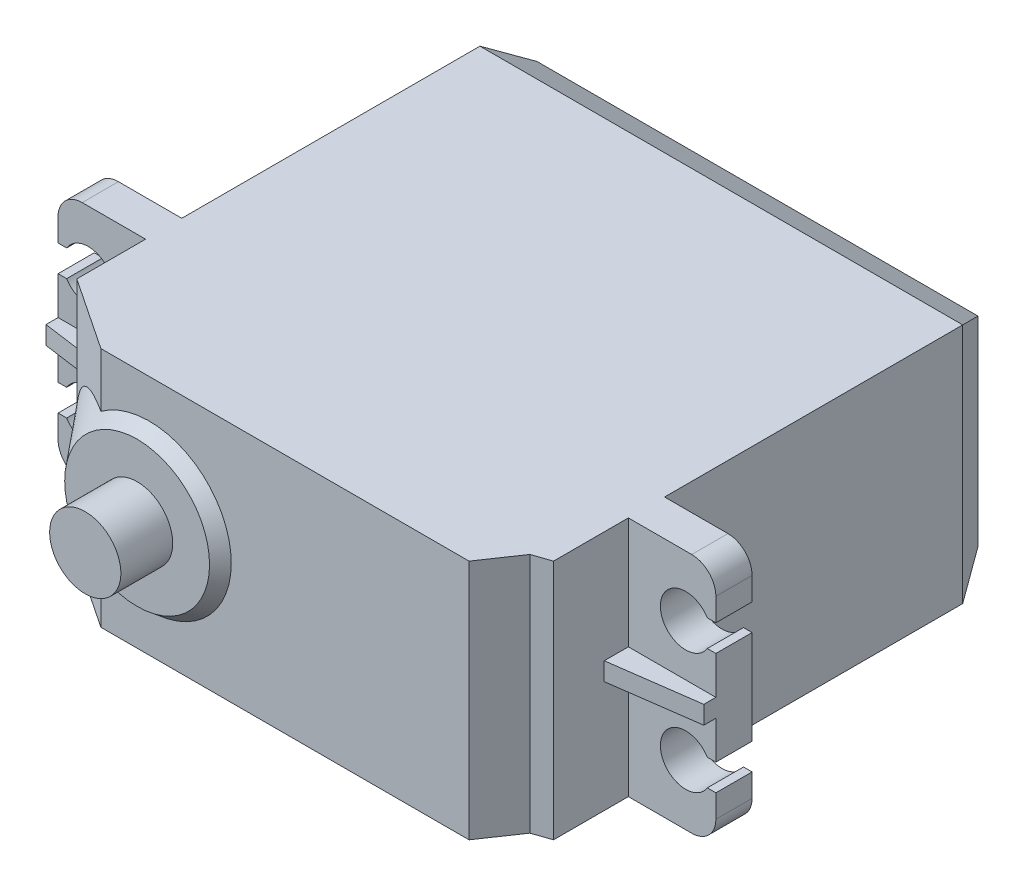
ISO-10303-21;
HEADER;
FILE_DESCRIPTION(('STEP AP214'),'2;1');
FILE_NAME('part.step','',(''),(''),'','','');
FILE_SCHEMA(('AUTOMOTIVE_DESIGN { 1 0 10303 214 1 1 1 1 }'));
ENDSEC;
DATA;
#1=APPLICATION_CONTEXT('core data for automotive mechanical design processes');
#2=APPLICATION_PROTOCOL_DEFINITION('international standard','automotive_design',2000,#1);
#3=PRODUCT_CONTEXT('',#1,'mechanical');
#4=PRODUCT('Part','Part','',(#3));
#5=PRODUCT_RELATED_PRODUCT_CATEGORY('part','',(#4));
#6=PRODUCT_DEFINITION_FORMATION('','',#4);
#7=PRODUCT_DEFINITION_CONTEXT('part definition',#1,'design');
#8=PRODUCT_DEFINITION('design','',#6,#7);
#9=PRODUCT_DEFINITION_SHAPE('','',#8);
#10=(LENGTH_UNIT() NAMED_UNIT(*) SI_UNIT(.MILLI.,.METRE.));
#11=(NAMED_UNIT(*) PLANE_ANGLE_UNIT() SI_UNIT($,.RADIAN.));
#12=(NAMED_UNIT(*) SI_UNIT($,.STERADIAN.) SOLID_ANGLE_UNIT());
#13=UNCERTAINTY_MEASURE_WITH_UNIT(LENGTH_MEASURE(1.E-05),#10,'distance_accuracy_value','');
#14=(GEOMETRIC_REPRESENTATION_CONTEXT(3) GLOBAL_UNCERTAINTY_ASSIGNED_CONTEXT((#13)) GLOBAL_UNIT_ASSIGNED_CONTEXT((#10,
#11,#12)) REPRESENTATION_CONTEXT('',''));
#15=CARTESIAN_POINT('',(0.,0.,0.));
#16=DIRECTION('',(0.,0.,1.));
#17=DIRECTION('',(1.,0.,0.));
#18=AXIS2_PLACEMENT_3D('',#15,#16,#17);
#19=CARTESIAN_POINT('',(-9.99999999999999,0.,41.4));
#20=DIRECTION('',(0.,0.,-1.));
#21=DIRECTION('',(-1.,0.,0.));
#22=AXIS2_PLACEMENT_3D('',#19,#20,#21);
#23=PLANE('',#22);
#24=CARTESIAN_POINT('',(-9.99999999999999,0.,41.4));
#25=DIRECTION('',(0.,0.,1.));
#26=DIRECTION('',(1.,0.,0.));
#27=AXIS2_PLACEMENT_3D('',#24,#25,#26);
#28=CIRCLE('',#27,6.);
#29=CARTESIAN_POINT('',(-3.99999999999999,0.,41.4));
#30=VERTEX_POINT('',#29);
#31=EDGE_CURVE('E348',#30,#30,#28,.T.);
#32=ORIENTED_EDGE('',*,*,#31,.T.);
#33=EDGE_LOOP('',(#32));
#34=FACE_BOUND('',#33,.T.);
#35=CARTESIAN_POINT('',(-9.99999999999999,0.,41.4));
#36=DIRECTION('',(0.,0.,-1.));
#37=DIRECTION('',(-1.,0.,0.));
#38=AXIS2_PLACEMENT_3D('',#35,#36,#37);
#39=CIRCLE('',#38,2.95);
#40=CARTESIAN_POINT('',(-12.95,0.,41.4));
#41=VERTEX_POINT('',#40);
#42=EDGE_CURVE('E11',#41,#41,#39,.F.);
#43=ORIENTED_EDGE('',*,*,#42,.F.);
#44=EDGE_LOOP('',(#43));
#45=FACE_BOUND('',#44,.T.);
#46=ADVANCED_FACE('F33',(#34,#45),#23,.F.);
#47=CARTESIAN_POINT('',(0.,0.,40.4));
#48=DIRECTION('',(0.,0.,1.));
#49=DIRECTION('',(1.,0.,0.));
#50=AXIS2_PLACEMENT_3D('',#47,#48,#49);
#51=PLANE('',#50);
#52=DIRECTION('',(0.,-1.,0.));
#53=VECTOR('',#52,1.);
#54=CARTESIAN_POINT('',(-14.,-10.,40.4));
#55=LINE('',#54,#53);
#56=CARTESIAN_POINT('',(-13.9999999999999,9.99999999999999,40.4));
#57=VERTEX_POINT('',#56);
#58=CARTESIAN_POINT('',(-14.,5.49909083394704,40.4));
#59=VERTEX_POINT('',#58);
#60=EDGE_CURVE('E346',#57,#59,#55,.T.);
#61=ORIENTED_EDGE('',*,*,#60,.T.);
#62=CARTESIAN_POINT('',(-9.99999999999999,0.,40.4));
#63=DIRECTION('',(0.,0.,1.));
#64=DIRECTION('',(1.,0.,0.));
#65=AXIS2_PLACEMENT_3D('',#62,#63,#64);
#66=CIRCLE('',#65,6.80000000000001);
#67=CARTESIAN_POINT('',(-14.,-5.49909083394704,40.4));
#68=VERTEX_POINT('',#67);
#69=EDGE_CURVE('E332',#59,#68,#66,.F.);
#70=ORIENTED_EDGE('',*,*,#69,.T.);
#71=CARTESIAN_POINT('',(-13.9999999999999,-10.,40.4));
#72=VERTEX_POINT('',#71);
#73=EDGE_CURVE('E343',#68,#72,#55,.T.);
#74=ORIENTED_EDGE('',*,*,#73,.T.);
#75=DIRECTION('',(1.,0.,0.));
#76=VECTOR('',#75,1.);
#77=CARTESIAN_POINT('',(20.,-10.,40.4));
#78=LINE('',#77,#76);
#79=CARTESIAN_POINT('',(16.5,-10.,40.4));
#80=VERTEX_POINT('',#79);
#81=EDGE_CURVE('E739',#72,#80,#78,.T.);
#82=ORIENTED_EDGE('',*,*,#81,.T.);
#83=DIRECTION('',(0.,-1.,0.));
#84=VECTOR('',#83,1.);
#85=CARTESIAN_POINT('',(16.5,0.,40.4));
#86=LINE('',#85,#84);
#87=CARTESIAN_POINT('',(16.5,10.,40.4));
#88=VERTEX_POINT('',#87);
#89=EDGE_CURVE('E404',#88,#80,#86,.T.);
#90=ORIENTED_EDGE('',*,*,#89,.F.);
#91=DIRECTION('',(-1.,0.,0.));
#92=VECTOR('',#91,1.);
#93=CARTESIAN_POINT('',(20.,10.,40.4));
#94=LINE('',#93,#92);
#95=EDGE_CURVE('E387',#88,#57,#94,.T.);
#96=ORIENTED_EDGE('',*,*,#95,.T.);
#97=EDGE_LOOP('',(#61,#70,#74,#82,#90,#96));
#98=FACE_BOUND('',#97,.T.);
#99=ADVANCED_FACE('F341',(#98),#51,.T.);
#100=CARTESIAN_POINT('',(-14.,0.,40.4));
#101=DIRECTION('',(-0.554700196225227,0.,0.832050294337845));
#102=DIRECTION('',(0.,1.,0.));
#103=AXIS2_PLACEMENT_3D('',#100,#101,#102);
#104=PLANE('',#103);
#105=DIRECTION('',(0.,1.,0.));
#106=VECTOR('',#105,1.);
#107=CARTESIAN_POINT('',(-20.,9.99999999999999,36.4));
#108=LINE('',#107,#106);
#109=CARTESIAN_POINT('',(-20.,0.,36.4));
#110=VERTEX_POINT('',#109);
#111=CARTESIAN_POINT('',(-20.,9.99999999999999,36.4));
#112=VERTEX_POINT('',#111);
#113=EDGE_CURVE('E401',#110,#112,#108,.T.);
#114=ORIENTED_EDGE('',*,*,#113,.F.);
#115=CARTESIAN_POINT('',(-13.4782608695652,0.,40.7478260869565));
#116=DIRECTION('',(-0.554700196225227,0.,0.832050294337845));
#117=DIRECTION('',(-0.832050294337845,0.,-0.554700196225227));
#118=AXIS2_PLACEMENT_3D('',#115,#116,#117);
#119=ELLIPSE('',#118,7.83815494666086,5.51677284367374);
#120=EDGE_CURVE('E41',#110,#59,#119,.F.);
#121=ORIENTED_EDGE('',*,*,#120,.T.);
#122=ORIENTED_EDGE('',*,*,#60,.F.);
#123=DIRECTION('',(0.832050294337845,0.,0.554700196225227));
#124=VECTOR('',#123,1.);
#125=CARTESIAN_POINT('',(-14.,9.99999999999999,40.4));
#126=LINE('',#125,#124);
#127=EDGE_CURVE('E400',#112,#57,#126,.T.);
#128=ORIENTED_EDGE('',*,*,#127,.F.);
#129=EDGE_LOOP('',(#114,#121,#122,#128));
#130=FACE_BOUND('',#129,.T.);
#131=ADVANCED_FACE('F35',(#130),#104,.T.);
#132=ORIENTED_EDGE('',*,*,#73,.F.);
#133=EDGE_CURVE('E328',#68,#110,#119,.F.);
#134=ORIENTED_EDGE('',*,*,#133,.T.);
#135=CARTESIAN_POINT('',(-20.,-10.,36.4));
#136=VERTEX_POINT('',#135);
#137=EDGE_CURVE('E397',#136,#110,#108,.T.);
#138=ORIENTED_EDGE('',*,*,#137,.F.);
#139=DIRECTION('',(-0.832050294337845,0.,-0.554700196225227));
#140=VECTOR('',#139,1.);
#141=CARTESIAN_POINT('',(-14.,-10.,40.4));
#142=LINE('',#141,#140);
#143=EDGE_CURVE('E351',#72,#136,#142,.T.);
#144=ORIENTED_EDGE('',*,*,#143,.F.);
#145=EDGE_LOOP('',(#132,#134,#138,#144));
#146=FACE_BOUND('',#145,.T.);
#147=ADVANCED_FACE('F350',(#146),#104,.T.);
#148=CARTESIAN_POINT('',(20.,-10.,40.4));
#149=DIRECTION('',(-1.,0.,0.));
#150=DIRECTION('',(0.,0.,1.));
#151=AXIS2_PLACEMENT_3D('',#148,#149,#150);
#152=PLANE('',#151);
#153=DIRECTION('',(0.,0.,-1.));
#154=VECTOR('',#153,1.);
#155=CARTESIAN_POINT('',(20.,10.,40.4));
#156=LINE('',#155,#154);
#157=CARTESIAN_POINT('',(20.,10.,36.9));
#158=VERTEX_POINT('',#157);
#159=CARTESIAN_POINT('',(20.,10.,30.7));
#160=VERTEX_POINT('',#159);
#161=EDGE_CURVE('E406',#158,#160,#156,.T.);
#162=ORIENTED_EDGE('',*,*,#161,.F.);
#163=DIRECTION('',(0.,-1.,0.));
#164=VECTOR('',#163,1.);
#165=CARTESIAN_POINT('',(20.,10.00005,36.9));
#166=LINE('',#165,#164);
#167=CARTESIAN_POINT('',(20.,-10.,36.9));
#168=VERTEX_POINT('',#167);
#169=EDGE_CURVE('E770',#158,#168,#166,.T.);
#170=ORIENTED_EDGE('',*,*,#169,.T.);
#171=DIRECTION('',(0.,0.,-1.));
#172=VECTOR('',#171,1.);
#173=CARTESIAN_POINT('',(20.,-10.,40.4));
#174=LINE('',#173,#172);
#175=CARTESIAN_POINT('',(20.,-10.,30.7));
#176=VERTEX_POINT('',#175);
#177=EDGE_CURVE('E379',#168,#176,#174,.T.);
#178=ORIENTED_EDGE('',*,*,#177,.T.);
#179=DIRECTION('',(0.,1.,0.));
#180=VECTOR('',#179,1.);
#181=CARTESIAN_POINT('',(20.,10.,30.7));
#182=LINE('',#181,#180);
#183=CARTESIAN_POINT('',(20.,-0.749999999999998,30.7));
#184=VERTEX_POINT('',#183);
#185=EDGE_CURVE('E421',#176,#184,#182,.T.);
#186=ORIENTED_EDGE('',*,*,#185,.T.);
#187=DIRECTION('',(0.,0.,1.));
#188=VECTOR('',#187,1.);
#189=CARTESIAN_POINT('',(20.,-0.749999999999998,32.7));
#190=LINE('',#189,#188);
#191=CARTESIAN_POINT('',(20.,-0.749999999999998,32.7));
#192=VERTEX_POINT('',#191);
#193=EDGE_CURVE('E494',#184,#192,#190,.T.);
#194=ORIENTED_EDGE('',*,*,#193,.T.);
#195=DIRECTION('',(0.,1.,0.));
#196=VECTOR('',#195,1.);
#197=CARTESIAN_POINT('',(20.,-0.749999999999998,32.7));
#198=LINE('',#197,#196);
#199=CARTESIAN_POINT('',(20.,0.750000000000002,32.7));
#200=VERTEX_POINT('',#199);
#201=EDGE_CURVE('E500',#192,#200,#198,.T.);
#202=ORIENTED_EDGE('',*,*,#201,.T.);
#203=DIRECTION('',(0.,0.,1.));
#204=VECTOR('',#203,1.);
#205=CARTESIAN_POINT('',(20.,0.750000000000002,32.7));
#206=LINE('',#205,#204);
#207=CARTESIAN_POINT('',(20.,0.750000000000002,30.7));
#208=VERTEX_POINT('',#207);
#209=EDGE_CURVE('E480',#208,#200,#206,.T.);
#210=ORIENTED_EDGE('',*,*,#209,.F.);
#211=EDGE_CURVE('E425',#208,#160,#182,.T.);
#212=ORIENTED_EDGE('',*,*,#211,.T.);
#213=EDGE_LOOP('',(#162,#170,#178,#186,#194,#202,#210,#212));
#214=FACE_BOUND('',#213,.T.);
#215=ADVANCED_FACE('F776',(#214),#152,.F.);
#216=CARTESIAN_POINT('',(24.75,-5.,30.7));
#217=DIRECTION('',(0.,0.,-1.));
#218=DIRECTION('',(-1.,0.,0.));
#219=AXIS2_PLACEMENT_3D('',#216,#217,#218);
#220=PLANE('',#219);
#221=DIRECTION('',(-1.,0.,0.));
#222=VECTOR('',#221,1.);
#223=CARTESIAN_POINT('',(20.,-0.749999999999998,30.7));
#224=LINE('',#223,#222);
#225=CARTESIAN_POINT('',(27.25,-0.749999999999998,30.7));
#226=VERTEX_POINT('',#225);
#227=EDGE_CURVE('E491',#226,#184,#224,.T.);
#228=ORIENTED_EDGE('',*,*,#227,.T.);
#229=ORIENTED_EDGE('',*,*,#185,.F.);
#230=DIRECTION('',(-1.,0.,0.));
#231=VECTOR('',#230,1.);
#232=CARTESIAN_POINT('',(20.,-10.,30.7));
#233=LINE('',#232,#231);
#234=CARTESIAN_POINT('',(25.25,-10.,30.7));
#235=VERTEX_POINT('',#234);
#236=EDGE_CURVE('E754',#235,#176,#233,.T.);
#237=ORIENTED_EDGE('',*,*,#236,.F.);
#238=CARTESIAN_POINT('',(25.25,-8.,30.7));
#239=DIRECTION('',(0.,0.,-1.));
#240=DIRECTION('',(-1.,0.,0.));
#241=AXIS2_PLACEMENT_3D('',#238,#239,#240);
#242=CIRCLE('',#241,2.);
#243=CARTESIAN_POINT('',(27.25,-8.,30.7));
#244=VERTEX_POINT('',#243);
#245=EDGE_CURVE('E837',#235,#244,#242,.F.);
#246=ORIENTED_EDGE('',*,*,#245,.T.);
#247=DIRECTION('',(0.,-1.,0.));
#248=VECTOR('',#247,1.);
#249=CARTESIAN_POINT('',(27.25,-6.1,30.7));
#250=LINE('',#249,#248);
#251=CARTESIAN_POINT('',(27.25,-6.1,30.7));
#252=VERTEX_POINT('',#251);
#253=EDGE_CURVE('E724',#252,#244,#250,.T.);
#254=ORIENTED_EDGE('',*,*,#253,.F.);
#255=DIRECTION('',(1.,0.,0.));
#256=VECTOR('',#255,1.);
#257=CARTESIAN_POINT('',(27.25,-6.1,30.7));
#258=LINE('',#257,#256);
#259=CARTESIAN_POINT('',(26.5388543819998,-6.1,30.7));
#260=VERTEX_POINT('',#259);
#261=EDGE_CURVE('E808',#260,#252,#258,.T.);
#262=ORIENTED_EDGE('',*,*,#261,.F.);
#263=CARTESIAN_POINT('',(24.75,-5.,30.7));
#264=DIRECTION('',(0.,0.,1.));
#265=DIRECTION('',(-1.,0.,0.));
#266=AXIS2_PLACEMENT_3D('',#263,#264,#265);
#267=CIRCLE('',#266,2.1);
#268=CARTESIAN_POINT('',(26.5388543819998,-3.9,30.7));
#269=VERTEX_POINT('',#268);
#270=EDGE_CURVE('E805',#269,#260,#267,.T.);
#271=ORIENTED_EDGE('',*,*,#270,.F.);
#272=DIRECTION('',(-1.,0.,0.));
#273=VECTOR('',#272,1.);
#274=CARTESIAN_POINT('',(27.25,-3.9,30.7));
#275=LINE('',#274,#273);
#276=CARTESIAN_POINT('',(27.25,-3.9,30.7));
#277=VERTEX_POINT('',#276);
#278=EDGE_CURVE('E802',#277,#269,#275,.T.);
#279=ORIENTED_EDGE('',*,*,#278,.F.);
#280=DIRECTION('',(0.,-1.,0.));
#281=VECTOR('',#280,1.);
#282=CARTESIAN_POINT('',(27.25,3.9,30.7));
#283=LINE('',#282,#281);
#284=EDGE_CURVE('E798',#226,#277,#283,.T.);
#285=ORIENTED_EDGE('',*,*,#284,.F.);
#286=EDGE_LOOP('',(#228,#229,#237,#246,#254,#262,#271,#279,#285));
#287=FACE_BOUND('',#286,.T.);
#288=ADVANCED_FACE('F835',(#287),#220,.F.);
#289=CARTESIAN_POINT('',(-20.,-10.,40.4));
#290=DIRECTION('',(1.,0.,0.));
#291=DIRECTION('',(0.,0.,-1.));
#292=AXIS2_PLACEMENT_3D('',#289,#290,#291);
#293=PLANE('',#292);
#294=DIRECTION('',(0.,0.,-1.));
#295=VECTOR('',#294,1.);
#296=CARTESIAN_POINT('',(-20.,-10.,40.4));
#297=LINE('',#296,#295);
#298=CARTESIAN_POINT('',(-20.,-10.,30.7));
#299=VERTEX_POINT('',#298);
#300=EDGE_CURVE('E361',#136,#299,#297,.T.);
#301=ORIENTED_EDGE('',*,*,#300,.F.);
#302=ORIENTED_EDGE('',*,*,#137,.T.);
#303=ORIENTED_EDGE('',*,*,#113,.T.);
#304=DIRECTION('',(0.,0.,-1.));
#305=VECTOR('',#304,1.);
#306=CARTESIAN_POINT('',(-20.,9.99999999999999,40.4));
#307=LINE('',#306,#305);
#308=CARTESIAN_POINT('',(-20.,10.,30.7));
#309=VERTEX_POINT('',#308);
#310=EDGE_CURVE('E386',#112,#309,#307,.T.);
#311=ORIENTED_EDGE('',*,*,#310,.T.);
#312=DIRECTION('',(0.,-1.,0.));
#313=VECTOR('',#312,1.);
#314=CARTESIAN_POINT('',(-20.,10.,30.7));
#315=LINE('',#314,#313);
#316=CARTESIAN_POINT('',(-20.,0.749999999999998,30.7));
#317=VERTEX_POINT('',#316);
#318=EDGE_CURVE('E388',#309,#317,#315,.T.);
#319=ORIENTED_EDGE('',*,*,#318,.T.);
#320=DIRECTION('',(0.,0.,-1.));
#321=VECTOR('',#320,1.);
#322=CARTESIAN_POINT('',(-20.,0.749999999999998,32.7));
#323=LINE('',#322,#321);
#324=CARTESIAN_POINT('',(-20.,0.749999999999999,32.7));
#325=VERTEX_POINT('',#324);
#326=EDGE_CURVE('E514',#325,#317,#323,.T.);
#327=ORIENTED_EDGE('',*,*,#326,.F.);
#328=DIRECTION('',(0.,1.,0.));
#329=VECTOR('',#328,1.);
#330=CARTESIAN_POINT('',(-20.,-0.750000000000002,32.7));
#331=LINE('',#330,#329);
#332=CARTESIAN_POINT('',(-20.,-0.750000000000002,32.7));
#333=VERTEX_POINT('',#332);
#334=EDGE_CURVE('E528',#333,#325,#331,.T.);
#335=ORIENTED_EDGE('',*,*,#334,.F.);
#336=DIRECTION('',(0.,0.,-1.));
#337=VECTOR('',#336,1.);
#338=CARTESIAN_POINT('',(-20.,-0.750000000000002,32.7));
#339=LINE('',#338,#337);
#340=CARTESIAN_POINT('',(-20.,-0.750000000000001,30.7));
#341=VERTEX_POINT('',#340);
#342=EDGE_CURVE('E525',#333,#341,#339,.T.);
#343=ORIENTED_EDGE('',*,*,#342,.T.);
#344=EDGE_CURVE('E440',#341,#299,#315,.T.);
#345=ORIENTED_EDGE('',*,*,#344,.T.);
#346=EDGE_LOOP('',(#301,#302,#303,#311,#319,#327,#335,#343,#345));
#347=FACE_BOUND('',#346,.T.);
#348=ADVANCED_FACE('F694',(#347),#293,.F.);
#349=CARTESIAN_POINT('',(-24.75,-5.,30.7));
#350=DIRECTION('',(0.,0.,1.));
#351=DIRECTION('',(1.,0.,0.));
#352=AXIS2_PLACEMENT_3D('',#349,#350,#351);
#353=PLANE('',#352);
#354=ORIENTED_EDGE('',*,*,#344,.F.);
#355=DIRECTION('',(-1.,0.,0.));
#356=VECTOR('',#355,1.);
#357=CARTESIAN_POINT('',(-20.,-0.750000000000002,30.7));
#358=LINE('',#357,#356);
#359=CARTESIAN_POINT('',(-27.25,-0.750000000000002,30.7));
#360=VERTEX_POINT('',#359);
#361=EDGE_CURVE('E517',#341,#360,#358,.T.);
#362=ORIENTED_EDGE('',*,*,#361,.T.);
#363=DIRECTION('',(0.,1.,0.));
#364=VECTOR('',#363,1.);
#365=CARTESIAN_POINT('',(-27.25,3.9,30.7));
#366=LINE('',#365,#364);
#367=CARTESIAN_POINT('',(-27.25,-3.9,30.7));
#368=VERTEX_POINT('',#367);
#369=EDGE_CURVE('E548',#368,#360,#366,.T.);
#370=ORIENTED_EDGE('',*,*,#369,.F.);
#371=DIRECTION('',(-1.,0.,0.));
#372=VECTOR('',#371,1.);
#373=CARTESIAN_POINT('',(-27.25,-3.9,30.7));
#374=LINE('',#373,#372);
#375=CARTESIAN_POINT('',(-26.5388543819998,-3.9,30.7));
#376=VERTEX_POINT('',#375);
#377=EDGE_CURVE('E544',#376,#368,#374,.T.);
#378=ORIENTED_EDGE('',*,*,#377,.F.);
#379=CARTESIAN_POINT('',(-24.75,-5.,30.7));
#380=DIRECTION('',(0.,0.,1.));
#381=DIRECTION('',(1.,0.,0.));
#382=AXIS2_PLACEMENT_3D('',#379,#380,#381);
#383=CIRCLE('',#382,2.1);
#384=CARTESIAN_POINT('',(-26.5388543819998,-6.1,30.7));
#385=VERTEX_POINT('',#384);
#386=EDGE_CURVE('E541',#385,#376,#383,.T.);
#387=ORIENTED_EDGE('',*,*,#386,.F.);
#388=DIRECTION('',(1.,0.,0.));
#389=VECTOR('',#388,1.);
#390=CARTESIAN_POINT('',(-27.25,-6.1,30.7));
#391=LINE('',#390,#389);
#392=CARTESIAN_POINT('',(-27.25,-6.1,30.7));
#393=VERTEX_POINT('',#392);
#394=EDGE_CURVE('E537',#393,#385,#391,.T.);
#395=ORIENTED_EDGE('',*,*,#394,.F.);
#396=DIRECTION('',(0.,1.,0.));
#397=VECTOR('',#396,1.);
#398=CARTESIAN_POINT('',(-27.25,-6.1,30.7));
#399=LINE('',#398,#397);
#400=CARTESIAN_POINT('',(-27.25,-8.00000000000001,30.7));
#401=VERTEX_POINT('',#400);
#402=EDGE_CURVE('E534',#401,#393,#399,.T.);
#403=ORIENTED_EDGE('',*,*,#402,.F.);
#404=CARTESIAN_POINT('',(-25.25,-8.00000000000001,30.7));
#405=DIRECTION('',(0.,0.,1.));
#406=DIRECTION('',(1.,0.,0.));
#407=AXIS2_PLACEMENT_3D('',#404,#405,#406);
#408=CIRCLE('',#407,2.);
#409=CARTESIAN_POINT('',(-25.25,-10.,30.7));
#410=VERTEX_POINT('',#409);
#411=EDGE_CURVE('E594',#401,#410,#408,.T.);
#412=ORIENTED_EDGE('',*,*,#411,.T.);
#413=DIRECTION('',(-1.,0.,0.));
#414=VECTOR('',#413,1.);
#415=CARTESIAN_POINT('',(-20.,-10.,30.7));
#416=LINE('',#415,#414);
#417=EDGE_CURVE('E538',#299,#410,#416,.T.);
#418=ORIENTED_EDGE('',*,*,#417,.F.);
#419=EDGE_LOOP('',(#354,#362,#370,#378,#387,#395,#403,#412,#418));
#420=FACE_BOUND('',#419,.T.);
#421=ADVANCED_FACE('F698',(#420),#353,.T.);
#422=CARTESIAN_POINT('',(-20.,10.,27.7));
#423=VERTEX_POINT('',#422);
#424=CARTESIAN_POINT('',(-20.,9.99999999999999,3.00000000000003));
#425=VERTEX_POINT('',#424);
#426=EDGE_CURVE('E382',#423,#425,#307,.T.);
#427=ORIENTED_EDGE('',*,*,#426,.T.);
#428=DIRECTION('',(0.,-1.,0.));
#429=VECTOR('',#428,1.);
#430=CARTESIAN_POINT('',(-20.,-10.,3.00000000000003));
#431=LINE('',#430,#429);
#432=CARTESIAN_POINT('',(-20.,-10.,3.00000000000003));
#433=VERTEX_POINT('',#432);
#434=EDGE_CURVE('E353',#425,#433,#431,.T.);
#435=ORIENTED_EDGE('',*,*,#434,.T.);
#436=CARTESIAN_POINT('',(-20.,-10.,27.7));
#437=VERTEX_POINT('',#436);
#438=EDGE_CURVE('E365',#437,#433,#297,.T.);
#439=ORIENTED_EDGE('',*,*,#438,.F.);
#440=DIRECTION('',(0.,-1.,0.));
#441=VECTOR('',#440,1.);
#442=CARTESIAN_POINT('',(-20.,10.,27.7));
#443=LINE('',#442,#441);
#444=EDGE_CURVE('E531',#423,#437,#443,.T.);
#445=ORIENTED_EDGE('',*,*,#444,.F.);
#446=EDGE_LOOP('',(#427,#435,#439,#445));
#447=FACE_BOUND('',#446,.T.);
#448=ADVANCED_FACE('F863',(#447),#293,.F.);
#449=CARTESIAN_POINT('',(20.,-10.,27.7));
#450=VERTEX_POINT('',#449);
#451=CARTESIAN_POINT('',(20.,-10.,3.00000000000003));
#452=VERTEX_POINT('',#451);
#453=EDGE_CURVE('E408',#450,#452,#174,.T.);
#454=ORIENTED_EDGE('',*,*,#453,.T.);
#455=DIRECTION('',(0.,1.,0.));
#456=VECTOR('',#455,1.);
#457=CARTESIAN_POINT('',(20.,-10.,3.00000000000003));
#458=LINE('',#457,#456);
#459=CARTESIAN_POINT('',(20.,10.,3.00000000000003));
#460=VERTEX_POINT('',#459);
#461=EDGE_CURVE('E455',#452,#460,#458,.T.);
#462=ORIENTED_EDGE('',*,*,#461,.T.);
#463=CARTESIAN_POINT('',(20.,10.,27.7));
#464=VERTEX_POINT('',#463);
#465=EDGE_CURVE('E372',#464,#460,#156,.T.);
#466=ORIENTED_EDGE('',*,*,#465,.F.);
#467=DIRECTION('',(0.,1.,0.));
#468=VECTOR('',#467,1.);
#469=CARTESIAN_POINT('',(20.,10.,27.7));
#470=LINE('',#469,#468);
#471=EDGE_CURVE('E605',#450,#464,#470,.T.);
#472=ORIENTED_EDGE('',*,*,#471,.F.);
#473=EDGE_LOOP('',(#454,#462,#466,#472));
#474=FACE_BOUND('',#473,.T.);
#475=ADVANCED_FACE('F870',(#474),#152,.F.);
#476=CARTESIAN_POINT('',(20.,-10.,40.4));
#477=DIRECTION('',(0.,1.,0.));
#478=DIRECTION('',(-1.,0.,0.));
#479=AXIS2_PLACEMENT_3D('',#476,#477,#478);
#480=PLANE('',#479);
#481=CARTESIAN_POINT('',(-9.99999999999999,-10.,36.4));
#482=VERTEX_POINT('',#481);
#483=VERTEX_LOOP('',#482);
#484=FACE_BOUND('',#483,.T.);
#485=ORIENTED_EDGE('',*,*,#177,.F.);
#486=DIRECTION('',(0.94606041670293,0.,-0.323990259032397));
#487=VECTOR('',#486,1.);
#488=CARTESIAN_POINT('',(18.5399863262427,-10.,37.4));
#489=LINE('',#488,#487);
#490=CARTESIAN_POINT('',(18.5399863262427,-10.,37.4));
#491=VERTEX_POINT('',#490);
#492=EDGE_CURVE('E762',#491,#168,#489,.T.);
#493=ORIENTED_EDGE('',*,*,#492,.F.);
#494=DIRECTION('',(0.562307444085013,0.,-0.826928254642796));
#495=VECTOR('',#494,1.);
#496=CARTESIAN_POINT('',(16.5,-10.,40.4));
#497=LINE('',#496,#495);
#498=EDGE_CURVE('E347',#80,#491,#497,.T.);
#499=ORIENTED_EDGE('',*,*,#498,.F.);
#500=ORIENTED_EDGE('',*,*,#81,.F.);
#501=ORIENTED_EDGE('',*,*,#143,.T.);
#502=ORIENTED_EDGE('',*,*,#300,.T.);
#503=ORIENTED_EDGE('',*,*,#417,.T.);
#504=DIRECTION('',(0.,0.,-1.));
#505=VECTOR('',#504,1.);
#506=CARTESIAN_POINT('',(-25.25,-10.,27.7));
#507=LINE('',#506,#505);
#508=CARTESIAN_POINT('',(-25.25,-10.,27.7));
#509=VERTEX_POINT('',#508);
#510=EDGE_CURVE('E704',#410,#509,#507,.T.);
#511=ORIENTED_EDGE('',*,*,#510,.T.);
#512=DIRECTION('',(-1.,0.,0.));
#513=VECTOR('',#512,1.);
#514=CARTESIAN_POINT('',(-20.,-10.,27.7));
#515=LINE('',#514,#513);
#516=EDGE_CURVE('E572',#437,#509,#515,.T.);
#517=ORIENTED_EDGE('',*,*,#516,.F.);
#518=ORIENTED_EDGE('',*,*,#438,.T.);
#519=DIRECTION('',(1.,0.,0.));
#520=VECTOR('',#519,1.);
#521=CARTESIAN_POINT('',(20.,-10.,3.00000000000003));
#522=LINE('',#521,#520);
#523=EDGE_CURVE('E442',#433,#452,#522,.T.);
#524=ORIENTED_EDGE('',*,*,#523,.T.);
#525=ORIENTED_EDGE('',*,*,#453,.F.);
#526=DIRECTION('',(-1.,0.,0.));
#527=VECTOR('',#526,1.);
#528=CARTESIAN_POINT('',(20.,-10.,27.7));
#529=LINE('',#528,#527);
#530=CARTESIAN_POINT('',(25.25,-10.,27.7));
#531=VERTEX_POINT('',#530);
#532=EDGE_CURVE('E439',#531,#450,#529,.T.);
#533=ORIENTED_EDGE('',*,*,#532,.F.);
#534=DIRECTION('',(0.,0.,-1.));
#535=VECTOR('',#534,1.);
#536=CARTESIAN_POINT('',(25.25,-10.,30.7));
#537=LINE('',#536,#535);
#538=EDGE_CURVE('E709',#531,#235,#537,.F.);
#539=ORIENTED_EDGE('',*,*,#538,.T.);
#540=ORIENTED_EDGE('',*,*,#236,.T.);
#541=EDGE_LOOP('',(#485,#493,#499,#500,#501,#502,#503,#511,#517,#518,#524,#525,#533,#539,#540));
#542=FACE_BOUND('',#541,.T.);
#543=ADVANCED_FACE('F703',(#484,#542),#480,.F.);
#544=CARTESIAN_POINT('',(20.,10.,40.4));
#545=DIRECTION('',(0.,-1.,0.));
#546=DIRECTION('',(1.,0.,0.));
#547=AXIS2_PLACEMENT_3D('',#544,#545,#546);
#548=PLANE('',#547);
#549=CARTESIAN_POINT('',(-9.99999999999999,9.99999999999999,36.4));
#550=VERTEX_POINT('',#549);
#551=VERTEX_LOOP('',#550);
#552=FACE_BOUND('',#551,.T.);
#553=DIRECTION('',(0.562307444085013,0.,-0.826928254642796));
#554=VECTOR('',#553,1.);
#555=CARTESIAN_POINT('',(17.606663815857,10.,38.7725423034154));
#556=LINE('',#555,#554);
#557=CARTESIAN_POINT('',(18.5399863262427,10.,37.4));
#558=VERTEX_POINT('',#557);
#559=EDGE_CURVE('E461',#88,#558,#556,.T.);
#560=ORIENTED_EDGE('',*,*,#559,.T.);
#561=DIRECTION('',(0.94606041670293,0.,-0.323990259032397));
#562=VECTOR('',#561,1.);
#563=CARTESIAN_POINT('',(18.9271997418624,10.,37.2673939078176));
#564=LINE('',#563,#562);
#565=EDGE_CURVE('E338',#558,#158,#564,.T.);
#566=ORIENTED_EDGE('',*,*,#565,.T.);
#567=ORIENTED_EDGE('',*,*,#161,.T.);
#568=DIRECTION('',(1.,0.,0.));
#569=VECTOR('',#568,1.);
#570=CARTESIAN_POINT('',(20.,10.,30.7));
#571=LINE('',#570,#569);
#572=CARTESIAN_POINT('',(25.25,10.,30.7));
#573=VERTEX_POINT('',#572);
#574=EDGE_CURVE('E424',#160,#573,#571,.T.);
#575=ORIENTED_EDGE('',*,*,#574,.T.);
#576=DIRECTION('',(0.,0.,-1.));
#577=VECTOR('',#576,1.);
#578=CARTESIAN_POINT('',(25.25,10.,27.7));
#579=LINE('',#578,#577);
#580=CARTESIAN_POINT('',(25.25,10.,27.7));
#581=VERTEX_POINT('',#580);
#582=EDGE_CURVE('E587',#573,#581,#579,.T.);
#583=ORIENTED_EDGE('',*,*,#582,.T.);
#584=DIRECTION('',(1.,0.,0.));
#585=VECTOR('',#584,1.);
#586=CARTESIAN_POINT('',(20.,10.,27.7));
#587=LINE('',#586,#585);
#588=EDGE_CURVE('E608',#464,#581,#587,.T.);
#589=ORIENTED_EDGE('',*,*,#588,.F.);
#590=ORIENTED_EDGE('',*,*,#465,.T.);
#591=DIRECTION('',(-1.,0.,0.));
#592=VECTOR('',#591,1.);
#593=CARTESIAN_POINT('',(20.,10.,3.00000000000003));
#594=LINE('',#593,#592);
#595=EDGE_CURVE('E355',#460,#425,#594,.T.);
#596=ORIENTED_EDGE('',*,*,#595,.T.);
#597=ORIENTED_EDGE('',*,*,#426,.F.);
#598=DIRECTION('',(1.,0.,0.));
#599=VECTOR('',#598,1.);
#600=CARTESIAN_POINT('',(-20.,10.,27.7));
#601=LINE('',#600,#599);
#602=CARTESIAN_POINT('',(-25.25,10.,27.7));
#603=VERTEX_POINT('',#602);
#604=EDGE_CURVE('E579',#603,#423,#601,.T.);
#605=ORIENTED_EDGE('',*,*,#604,.F.);
#606=DIRECTION('',(0.,0.,-1.));
#607=VECTOR('',#606,1.);
#608=CARTESIAN_POINT('',(-25.25,9.99999999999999,30.7));
#609=LINE('',#608,#607);
#610=CARTESIAN_POINT('',(-25.25,10.,30.7));
#611=VERTEX_POINT('',#610);
#612=EDGE_CURVE('E592',#603,#611,#609,.F.);
#613=ORIENTED_EDGE('',*,*,#612,.T.);
#614=DIRECTION('',(1.,0.,0.));
#615=VECTOR('',#614,1.);
#616=CARTESIAN_POINT('',(-20.,10.,30.7));
#617=LINE('',#616,#615);
#618=EDGE_CURVE('E563',#611,#309,#617,.T.);
#619=ORIENTED_EDGE('',*,*,#618,.T.);
#620=ORIENTED_EDGE('',*,*,#310,.F.);
#621=ORIENTED_EDGE('',*,*,#127,.T.);
#622=ORIENTED_EDGE('',*,*,#95,.F.);
#623=EDGE_LOOP('',(#560,#566,#567,#575,#583,#589,#590,#596,#597,#605,#613,#619,#620,#621,#622));
#624=FACE_BOUND('',#623,.T.);
#625=ADVANCED_FACE('F681',(#552,#624),#548,.F.);
#626=CARTESIAN_POINT('',(0.,0.,0.));
#627=DIRECTION('',(0.,0.,1.));
#628=DIRECTION('',(1.,0.,0.));
#629=AXIS2_PLACEMENT_3D('',#626,#627,#628);
#630=PLANE('',#629);
#631=DIRECTION('',(0.,-1.,0.));
#632=VECTOR('',#631,1.);
#633=CARTESIAN_POINT('',(18.2679491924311,0.,0.));
#634=LINE('',#633,#632);
#635=CARTESIAN_POINT('',(18.2679491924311,8.26794919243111,0.));
#636=VERTEX_POINT('',#635);
#637=CARTESIAN_POINT('',(18.2679491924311,-8.26794919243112,0.));
#638=VERTEX_POINT('',#637);
#639=EDGE_CURVE('E450',#636,#638,#634,.T.);
#640=ORIENTED_EDGE('',*,*,#639,.T.);
#641=DIRECTION('',(-1.,0.,0.));
#642=VECTOR('',#641,1.);
#643=CARTESIAN_POINT('',(0.,-8.26794919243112,0.));
#644=LINE('',#643,#642);
#645=CARTESIAN_POINT('',(-18.2679491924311,-8.26794919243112,0.));
#646=VERTEX_POINT('',#645);
#647=EDGE_CURVE('E452',#638,#646,#644,.T.);
#648=ORIENTED_EDGE('',*,*,#647,.T.);
#649=DIRECTION('',(0.,1.,0.));
#650=VECTOR('',#649,1.);
#651=CARTESIAN_POINT('',(-18.2679491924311,0.,0.));
#652=LINE('',#651,#650);
#653=CARTESIAN_POINT('',(-18.2679491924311,8.26794919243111,0.));
#654=VERTEX_POINT('',#653);
#655=EDGE_CURVE('E445',#646,#654,#652,.T.);
#656=ORIENTED_EDGE('',*,*,#655,.T.);
#657=DIRECTION('',(1.,0.,0.));
#658=VECTOR('',#657,1.);
#659=CARTESIAN_POINT('',(0.,8.26794919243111,0.));
#660=LINE('',#659,#658);
#661=EDGE_CURVE('E448',#654,#636,#660,.T.);
#662=ORIENTED_EDGE('',*,*,#661,.T.);
#663=EDGE_LOOP('',(#640,#648,#656,#662));
#664=FACE_BOUND('',#663,.T.);
#665=ADVANCED_FACE('F960',(#664),#630,.F.);
#666=CARTESIAN_POINT('',(27.25,-6.1,30.7));
#667=DIRECTION('',(1.,0.,0.));
#668=DIRECTION('',(0.,0.,-1.));
#669=AXIS2_PLACEMENT_3D('',#666,#667,#668);
#670=PLANE('',#669);
#671=ORIENTED_EDGE('',*,*,#253,.T.);
#672=DIRECTION('',(0.,0.,-1.));
#673=VECTOR('',#672,1.);
#674=CARTESIAN_POINT('',(27.25,-8.,27.7));
#675=LINE('',#674,#673);
#676=CARTESIAN_POINT('',(27.25,-8.,27.7));
#677=VERTEX_POINT('',#676);
#678=EDGE_CURVE('E446',#244,#677,#675,.T.);
#679=ORIENTED_EDGE('',*,*,#678,.T.);
#680=DIRECTION('',(0.,-1.,0.));
#681=VECTOR('',#680,1.);
#682=CARTESIAN_POINT('',(27.25,-6.1,27.7));
#683=LINE('',#682,#681);
#684=CARTESIAN_POINT('',(27.25,-6.1,27.7));
#685=VERTEX_POINT('',#684);
#686=EDGE_CURVE('E601',#685,#677,#683,.T.);
#687=ORIENTED_EDGE('',*,*,#686,.F.);
#688=DIRECTION('',(0.,0.,-1.));
#689=VECTOR('',#688,1.);
#690=CARTESIAN_POINT('',(27.25,-6.1,30.7));
#691=LINE('',#690,#689);
#692=EDGE_CURVE('E737',#252,#685,#691,.T.);
#693=ORIENTED_EDGE('',*,*,#692,.F.);
#694=EDGE_LOOP('',(#671,#679,#687,#693));
#695=FACE_BOUND('',#694,.T.);
#696=ADVANCED_FACE('F721',(#695),#670,.T.);
#697=CARTESIAN_POINT('',(27.25,-6.1,30.7));
#698=DIRECTION('',(0.,1.,0.));
#699=DIRECTION('',(0.,0.,1.));
#700=AXIS2_PLACEMENT_3D('',#697,#698,#699);
#701=PLANE('',#700);
#702=DIRECTION('',(1.,0.,0.));
#703=VECTOR('',#702,1.);
#704=CARTESIAN_POINT('',(27.25,-6.1,27.7));
#705=LINE('',#704,#703);
#706=CARTESIAN_POINT('',(26.5388543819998,-6.1,27.7));
#707=VERTEX_POINT('',#706);
#708=EDGE_CURVE('E731',#707,#685,#705,.T.);
#709=ORIENTED_EDGE('',*,*,#708,.F.);
#710=DIRECTION('',(0.,0.,-1.));
#711=VECTOR('',#710,1.);
#712=CARTESIAN_POINT('',(26.5388543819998,-6.1,30.7));
#713=LINE('',#712,#711);
#714=EDGE_CURVE('E740',#260,#707,#713,.T.);
#715=ORIENTED_EDGE('',*,*,#714,.F.);
#716=ORIENTED_EDGE('',*,*,#261,.T.);
#717=ORIENTED_EDGE('',*,*,#692,.T.);
#718=EDGE_LOOP('',(#709,#715,#716,#717));
#719=FACE_BOUND('',#718,.T.);
#720=ADVANCED_FACE('F833',(#719),#701,.T.);
#721=CARTESIAN_POINT('',(24.75,-5.,30.7));
#722=DIRECTION('',(0.,0.,-1.));
#723=DIRECTION('',(-1.,0.,0.));
#724=AXIS2_PLACEMENT_3D('',#721,#722,#723);
#725=CYLINDRICAL_SURFACE('',#724,2.1);
#726=CARTESIAN_POINT('',(24.75,-5.,27.7));
#727=DIRECTION('',(0.,0.,1.));
#728=DIRECTION('',(-1.,0.,0.));
#729=AXIS2_PLACEMENT_3D('',#726,#727,#728);
#730=CIRCLE('',#729,2.1);
#731=CARTESIAN_POINT('',(26.5388543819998,-3.9,27.7));
#732=VERTEX_POINT('',#731);
#733=EDGE_CURVE('E733',#732,#707,#730,.T.);
#734=ORIENTED_EDGE('',*,*,#733,.F.);
#735=DIRECTION('',(0.,0.,-1.));
#736=VECTOR('',#735,1.);
#737=CARTESIAN_POINT('',(26.5388543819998,-3.9,30.7));
#738=LINE('',#737,#736);
#739=EDGE_CURVE('E742',#269,#732,#738,.T.);
#740=ORIENTED_EDGE('',*,*,#739,.F.);
#741=ORIENTED_EDGE('',*,*,#270,.T.);
#742=ORIENTED_EDGE('',*,*,#714,.T.);
#743=EDGE_LOOP('',(#734,#740,#741,#742));
#744=FACE_BOUND('',#743,.T.);
#745=ADVANCED_FACE('F829',(#744),#725,.F.);
#746=CARTESIAN_POINT('',(27.25,-3.9,30.7));
#747=DIRECTION('',(0.,-1.,0.));
#748=DIRECTION('',(0.,0.,-1.));
#749=AXIS2_PLACEMENT_3D('',#746,#747,#748);
#750=PLANE('',#749);
#751=DIRECTION('',(-1.,0.,0.));
#752=VECTOR('',#751,1.);
#753=CARTESIAN_POINT('',(27.25,-3.9,27.7));
#754=LINE('',#753,#752);
#755=CARTESIAN_POINT('',(27.25,-3.9,27.7));
#756=VERTEX_POINT('',#755);
#757=EDGE_CURVE('E824',#756,#732,#754,.T.);
#758=ORIENTED_EDGE('',*,*,#757,.F.);
#759=DIRECTION('',(0.,0.,-1.));
#760=VECTOR('',#759,1.);
#761=CARTESIAN_POINT('',(27.25,-3.9,30.7));
#762=LINE('',#761,#760);
#763=EDGE_CURVE('E744',#277,#756,#762,.T.);
#764=ORIENTED_EDGE('',*,*,#763,.F.);
#765=ORIENTED_EDGE('',*,*,#278,.T.);
#766=ORIENTED_EDGE('',*,*,#739,.T.);
#767=EDGE_LOOP('',(#758,#764,#765,#766));
#768=FACE_BOUND('',#767,.T.);
#769=ADVANCED_FACE('F965',(#768),#750,.T.);
#770=CARTESIAN_POINT('',(27.25,3.9,30.7));
#771=DIRECTION('',(1.,0.,0.));
#772=DIRECTION('',(0.,1.,0.));
#773=AXIS2_PLACEMENT_3D('',#770,#771,#772);
#774=PLANE('',#773);
#775=DIRECTION('',(0.,-1.,0.));
#776=VECTOR('',#775,1.);
#777=CARTESIAN_POINT('',(27.25,3.9,27.7));
#778=LINE('',#777,#776);
#779=CARTESIAN_POINT('',(27.25,3.9,27.7));
#780=VERTEX_POINT('',#779);
#781=EDGE_CURVE('E821',#780,#756,#778,.T.);
#782=ORIENTED_EDGE('',*,*,#781,.F.);
#783=DIRECTION('',(0.,0.,-1.));
#784=VECTOR('',#783,1.);
#785=CARTESIAN_POINT('',(27.25,3.9,30.7));
#786=LINE('',#785,#784);
#787=CARTESIAN_POINT('',(27.25,3.9,30.7));
#788=VERTEX_POINT('',#787);
#789=EDGE_CURVE('E746',#788,#780,#786,.T.);
#790=ORIENTED_EDGE('',*,*,#789,.F.);
#791=CARTESIAN_POINT('',(27.25,0.750000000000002,30.7));
#792=VERTEX_POINT('',#791);
#793=EDGE_CURVE('E799',#788,#792,#283,.T.);
#794=ORIENTED_EDGE('',*,*,#793,.T.);
#795=DIRECTION('',(0.,0.,-1.));
#796=VECTOR('',#795,1.);
#797=CARTESIAN_POINT('',(27.25,0.750000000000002,30.7));
#798=LINE('',#797,#796);
#799=CARTESIAN_POINT('',(27.25,0.750000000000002,31.7));
#800=VERTEX_POINT('',#799);
#801=EDGE_CURVE('E469',#800,#792,#798,.T.);
#802=ORIENTED_EDGE('',*,*,#801,.F.);
#803=DIRECTION('',(0.,1.,0.));
#804=VECTOR('',#803,1.);
#805=CARTESIAN_POINT('',(27.25,-0.749999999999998,31.7));
#806=LINE('',#805,#804);
#807=CARTESIAN_POINT('',(27.25,-0.749999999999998,31.7));
#808=VERTEX_POINT('',#807);
#809=EDGE_CURVE('E501',#808,#800,#806,.T.);
#810=ORIENTED_EDGE('',*,*,#809,.F.);
#811=DIRECTION('',(0.,0.,-1.));
#812=VECTOR('',#811,1.);
#813=CARTESIAN_POINT('',(27.25,-0.749999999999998,30.7));
#814=LINE('',#813,#812);
#815=EDGE_CURVE('E488',#808,#226,#814,.T.);
#816=ORIENTED_EDGE('',*,*,#815,.T.);
#817=ORIENTED_EDGE('',*,*,#284,.T.);
#818=ORIENTED_EDGE('',*,*,#763,.T.);
#819=EDGE_LOOP('',(#782,#790,#794,#802,#810,#816,#817,#818));
#820=FACE_BOUND('',#819,.T.);
#821=ADVANCED_FACE('F968',(#820),#774,.T.);
#822=CARTESIAN_POINT('',(27.25,3.9,30.7));
#823=DIRECTION('',(0.,1.,0.));
#824=DIRECTION('',(0.,0.,1.));
#825=AXIS2_PLACEMENT_3D('',#822,#823,#824);
#826=PLANE('',#825);
#827=DIRECTION('',(1.,0.,0.));
#828=VECTOR('',#827,1.);
#829=CARTESIAN_POINT('',(27.25,3.9,27.7));
#830=LINE('',#829,#828);
#831=CARTESIAN_POINT('',(26.5388543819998,3.9,27.7));
#832=VERTEX_POINT('',#831);
#833=EDGE_CURVE('E818',#832,#780,#830,.T.);
#834=ORIENTED_EDGE('',*,*,#833,.F.);
#835=DIRECTION('',(0.,0.,-1.));
#836=VECTOR('',#835,1.);
#837=CARTESIAN_POINT('',(26.5388543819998,3.9,30.7));
#838=LINE('',#837,#836);
#839=CARTESIAN_POINT('',(26.5388543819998,3.9,30.7));
#840=VERTEX_POINT('',#839);
#841=EDGE_CURVE('E748',#840,#832,#838,.T.);
#842=ORIENTED_EDGE('',*,*,#841,.F.);
#843=DIRECTION('',(1.,0.,0.));
#844=VECTOR('',#843,1.);
#845=CARTESIAN_POINT('',(27.25,3.9,30.7));
#846=LINE('',#845,#844);
#847=EDGE_CURVE('E793',#840,#788,#846,.T.);
#848=ORIENTED_EDGE('',*,*,#847,.T.);
#849=ORIENTED_EDGE('',*,*,#789,.T.);
#850=EDGE_LOOP('',(#834,#842,#848,#849));
#851=FACE_BOUND('',#850,.T.);
#852=ADVANCED_FACE('F972',(#851),#826,.T.);
#853=CARTESIAN_POINT('',(24.75,5.,30.7));
#854=DIRECTION('',(0.,0.,-1.));
#855=DIRECTION('',(-1.,0.,0.));
#856=AXIS2_PLACEMENT_3D('',#853,#854,#855);
#857=CYLINDRICAL_SURFACE('',#856,2.1);
#858=CARTESIAN_POINT('',(24.75,5.,27.7));
#859=DIRECTION('',(0.,0.,1.));
#860=DIRECTION('',(-1.,0.,0.));
#861=AXIS2_PLACEMENT_3D('',#858,#859,#860);
#862=CIRCLE('',#861,2.1);
#863=CARTESIAN_POINT('',(26.5388543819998,6.1,27.7));
#864=VERTEX_POINT('',#863);
#865=EDGE_CURVE('E815',#864,#832,#862,.T.);
#866=ORIENTED_EDGE('',*,*,#865,.F.);
#867=DIRECTION('',(0.,0.,-1.));
#868=VECTOR('',#867,1.);
#869=CARTESIAN_POINT('',(26.5388543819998,6.1,30.7));
#870=LINE('',#869,#868);
#871=CARTESIAN_POINT('',(26.5388543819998,6.1,30.7));
#872=VERTEX_POINT('',#871);
#873=EDGE_CURVE('E750',#872,#864,#870,.T.);
#874=ORIENTED_EDGE('',*,*,#873,.F.);
#875=CARTESIAN_POINT('',(24.75,5.,30.7));
#876=DIRECTION('',(0.,0.,1.));
#877=DIRECTION('',(-1.,0.,0.));
#878=AXIS2_PLACEMENT_3D('',#875,#876,#877);
#879=CIRCLE('',#878,2.1);
#880=EDGE_CURVE('E789',#872,#840,#879,.T.);
#881=ORIENTED_EDGE('',*,*,#880,.T.);
#882=ORIENTED_EDGE('',*,*,#841,.T.);
#883=EDGE_LOOP('',(#866,#874,#881,#882));
#884=FACE_BOUND('',#883,.T.);
#885=ADVANCED_FACE('F976',(#884),#857,.F.);
#886=CARTESIAN_POINT('',(27.25,6.1,30.7));
#887=DIRECTION('',(0.,-1.,0.));
#888=DIRECTION('',(0.,0.,-1.));
#889=AXIS2_PLACEMENT_3D('',#886,#887,#888);
#890=PLANE('',#889);
#891=DIRECTION('',(-1.,0.,0.));
#892=VECTOR('',#891,1.);
#893=CARTESIAN_POINT('',(27.25,6.1,27.7));
#894=LINE('',#893,#892);
#895=CARTESIAN_POINT('',(27.25,6.1,27.7));
#896=VERTEX_POINT('',#895);
#897=EDGE_CURVE('E613',#896,#864,#894,.T.);
#898=ORIENTED_EDGE('',*,*,#897,.F.);
#899=DIRECTION('',(0.,0.,-1.));
#900=VECTOR('',#899,1.);
#901=CARTESIAN_POINT('',(27.25,6.1,30.7));
#902=LINE('',#901,#900);
#903=CARTESIAN_POINT('',(27.25,6.1,30.7));
#904=VERTEX_POINT('',#903);
#905=EDGE_CURVE('E752',#904,#896,#902,.T.);
#906=ORIENTED_EDGE('',*,*,#905,.F.);
#907=DIRECTION('',(-1.,0.,0.));
#908=VECTOR('',#907,1.);
#909=CARTESIAN_POINT('',(27.25,6.1,30.7));
#910=LINE('',#909,#908);
#911=EDGE_CURVE('E785',#904,#872,#910,.T.);
#912=ORIENTED_EDGE('',*,*,#911,.T.);
#913=ORIENTED_EDGE('',*,*,#873,.T.);
#914=EDGE_LOOP('',(#898,#906,#912,#913));
#915=FACE_BOUND('',#914,.T.);
#916=ADVANCED_FACE('F980',(#915),#890,.T.);
#917=CARTESIAN_POINT('',(27.25,10.,30.7));
#918=DIRECTION('',(1.,0.,0.));
#919=DIRECTION('',(0.,0.,-1.));
#920=AXIS2_PLACEMENT_3D('',#917,#918,#919);
#921=PLANE('',#920);
#922=DIRECTION('',(0.,-1.,0.));
#923=VECTOR('',#922,1.);
#924=CARTESIAN_POINT('',(27.25,10.,27.7));
#925=LINE('',#924,#923);
#926=CARTESIAN_POINT('',(27.25,8.,27.7));
#927=VERTEX_POINT('',#926);
#928=EDGE_CURVE('E610',#927,#896,#925,.T.);
#929=ORIENTED_EDGE('',*,*,#928,.F.);
#930=DIRECTION('',(0.,0.,-1.));
#931=VECTOR('',#930,1.);
#932=CARTESIAN_POINT('',(27.25,8.,30.7));
#933=LINE('',#932,#931);
#934=CARTESIAN_POINT('',(27.25,8.,30.7));
#935=VERTEX_POINT('',#934);
#936=EDGE_CURVE('E840',#927,#935,#933,.F.);
#937=ORIENTED_EDGE('',*,*,#936,.T.);
#938=DIRECTION('',(0.,-1.,0.));
#939=VECTOR('',#938,1.);
#940=CARTESIAN_POINT('',(27.25,10.,30.7));
#941=LINE('',#940,#939);
#942=EDGE_CURVE('E432',#935,#904,#941,.T.);
#943=ORIENTED_EDGE('',*,*,#942,.T.);
#944=ORIENTED_EDGE('',*,*,#905,.T.);
#945=EDGE_LOOP('',(#929,#937,#943,#944));
#946=FACE_BOUND('',#945,.T.);
#947=ADVANCED_FACE('F850',(#946),#921,.T.);
#948=ORIENTED_EDGE('',*,*,#211,.F.);
#949=DIRECTION('',(-1.,0.,0.));
#950=VECTOR('',#949,1.);
#951=CARTESIAN_POINT('',(20.,0.750000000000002,30.7));
#952=LINE('',#951,#950);
#953=EDGE_CURVE('E474',#792,#208,#952,.T.);
#954=ORIENTED_EDGE('',*,*,#953,.F.);
#955=ORIENTED_EDGE('',*,*,#793,.F.);
#956=ORIENTED_EDGE('',*,*,#847,.F.);
#957=ORIENTED_EDGE('',*,*,#880,.F.);
#958=ORIENTED_EDGE('',*,*,#911,.F.);
#959=ORIENTED_EDGE('',*,*,#942,.F.);
#960=CARTESIAN_POINT('',(25.25,8.,30.7));
#961=DIRECTION('',(0.,0.,-1.));
#962=DIRECTION('',(-1.,0.,0.));
#963=AXIS2_PLACEMENT_3D('',#960,#961,#962);
#964=CIRCLE('',#963,2.);
#965=EDGE_CURVE('E712',#935,#573,#964,.F.);
#966=ORIENTED_EDGE('',*,*,#965,.T.);
#967=ORIENTED_EDGE('',*,*,#574,.F.);
#968=EDGE_LOOP('',(#948,#954,#955,#956,#957,#958,#959,#966,#967));
#969=FACE_BOUND('',#968,.T.);
#970=ADVANCED_FACE('F781',(#969),#220,.F.);
#971=CARTESIAN_POINT('',(24.75,-5.,27.7));
#972=DIRECTION('',(0.,0.,-1.));
#973=DIRECTION('',(-1.,0.,0.));
#974=AXIS2_PLACEMENT_3D('',#971,#972,#973);
#975=PLANE('',#974);
#976=ORIENTED_EDGE('',*,*,#588,.T.);
#977=CARTESIAN_POINT('',(25.25,8.,27.7));
#978=DIRECTION('',(0.,0.,-1.));
#979=DIRECTION('',(-1.,0.,0.));
#980=AXIS2_PLACEMENT_3D('',#977,#978,#979);
#981=CIRCLE('',#980,2.);
#982=EDGE_CURVE('E842',#581,#927,#981,.T.);
#983=ORIENTED_EDGE('',*,*,#982,.T.);
#984=ORIENTED_EDGE('',*,*,#928,.T.);
#985=ORIENTED_EDGE('',*,*,#897,.T.);
#986=ORIENTED_EDGE('',*,*,#865,.T.);
#987=ORIENTED_EDGE('',*,*,#833,.T.);
#988=ORIENTED_EDGE('',*,*,#781,.T.);
#989=ORIENTED_EDGE('',*,*,#757,.T.);
#990=ORIENTED_EDGE('',*,*,#733,.T.);
#991=ORIENTED_EDGE('',*,*,#708,.T.);
#992=ORIENTED_EDGE('',*,*,#686,.T.);
#993=CARTESIAN_POINT('',(25.25,-8.,27.7));
#994=DIRECTION('',(0.,0.,-1.));
#995=DIRECTION('',(-1.,0.,0.));
#996=AXIS2_PLACEMENT_3D('',#993,#994,#995);
#997=CIRCLE('',#996,2.);
#998=EDGE_CURVE('E598',#677,#531,#997,.T.);
#999=ORIENTED_EDGE('',*,*,#998,.T.);
#1000=ORIENTED_EDGE('',*,*,#532,.T.);
#1001=ORIENTED_EDGE('',*,*,#471,.T.);
#1002=EDGE_LOOP('',(#976,#983,#984,#985,#986,#987,#988,#989,#990,#991,#992,#999,#1000,#1001));
#1003=FACE_BOUND('',#1002,.T.);
#1004=ADVANCED_FACE('F727',(#1003),#975,.T.);
#1005=CARTESIAN_POINT('',(-27.25,10.,30.7));
#1006=DIRECTION('',(-1.,0.,0.));
#1007=DIRECTION('',(0.,0.,1.));
#1008=AXIS2_PLACEMENT_3D('',#1005,#1006,#1007);
#1009=PLANE('',#1008);
#1010=DIRECTION('',(0.,1.,0.));
#1011=VECTOR('',#1010,1.);
#1012=CARTESIAN_POINT('',(-27.25,10.,30.7));
#1013=LINE('',#1012,#1011);
#1014=CARTESIAN_POINT('',(-27.25,6.1,30.7));
#1015=VERTEX_POINT('',#1014);
#1016=CARTESIAN_POINT('',(-27.25,7.99999999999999,30.7));
#1017=VERTEX_POINT('',#1016);
#1018=EDGE_CURVE('E560',#1015,#1017,#1013,.T.);
#1019=ORIENTED_EDGE('',*,*,#1018,.T.);
#1020=DIRECTION('',(0.,0.,-1.));
#1021=VECTOR('',#1020,1.);
#1022=CARTESIAN_POINT('',(-27.25,7.99999999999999,27.7));
#1023=LINE('',#1022,#1021);
#1024=CARTESIAN_POINT('',(-27.25,7.99999999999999,27.7));
#1025=VERTEX_POINT('',#1024);
#1026=EDGE_CURVE('E364',#1017,#1025,#1023,.T.);
#1027=ORIENTED_EDGE('',*,*,#1026,.T.);
#1028=DIRECTION('',(0.,1.,0.));
#1029=VECTOR('',#1028,1.);
#1030=CARTESIAN_POINT('',(-27.25,10.,27.7));
#1031=LINE('',#1030,#1029);
#1032=CARTESIAN_POINT('',(-27.25,6.1,27.7));
#1033=VERTEX_POINT('',#1032);
#1034=EDGE_CURVE('E582',#1033,#1025,#1031,.T.);
#1035=ORIENTED_EDGE('',*,*,#1034,.F.);
#1036=DIRECTION('',(0.,0.,-1.));
#1037=VECTOR('',#1036,1.);
#1038=CARTESIAN_POINT('',(-27.25,6.1,30.7));
#1039=LINE('',#1038,#1037);
#1040=EDGE_CURVE('E615',#1015,#1033,#1039,.T.);
#1041=ORIENTED_EDGE('',*,*,#1040,.F.);
#1042=EDGE_LOOP('',(#1019,#1027,#1035,#1041));
#1043=FACE_BOUND('',#1042,.T.);
#1044=ADVANCED_FACE('F671',(#1043),#1009,.T.);
#1045=CARTESIAN_POINT('',(-27.25,6.1,30.7));
#1046=DIRECTION('',(0.,-1.,0.));
#1047=DIRECTION('',(0.,0.,-1.));
#1048=AXIS2_PLACEMENT_3D('',#1045,#1046,#1047);
#1049=PLANE('',#1048);
#1050=DIRECTION('',(-1.,0.,0.));
#1051=VECTOR('',#1050,1.);
#1052=CARTESIAN_POINT('',(-27.25,6.1,27.7));
#1053=LINE('',#1052,#1051);
#1054=CARTESIAN_POINT('',(-26.5388543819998,6.1,27.7));
#1055=VERTEX_POINT('',#1054);
#1056=EDGE_CURVE('E664',#1055,#1033,#1053,.T.);
#1057=ORIENTED_EDGE('',*,*,#1056,.F.);
#1058=DIRECTION('',(0.,0.,-1.));
#1059=VECTOR('',#1058,1.);
#1060=CARTESIAN_POINT('',(-26.5388543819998,6.1,30.7));
#1061=LINE('',#1060,#1059);
#1062=CARTESIAN_POINT('',(-26.5388543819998,6.1,30.7));
#1063=VERTEX_POINT('',#1062);
#1064=EDGE_CURVE('E617',#1063,#1055,#1061,.T.);
#1065=ORIENTED_EDGE('',*,*,#1064,.F.);
#1066=DIRECTION('',(-1.,0.,0.));
#1067=VECTOR('',#1066,1.);
#1068=CARTESIAN_POINT('',(-27.25,6.1,30.7));
#1069=LINE('',#1068,#1067);
#1070=EDGE_CURVE('E557',#1063,#1015,#1069,.T.);
#1071=ORIENTED_EDGE('',*,*,#1070,.T.);
#1072=ORIENTED_EDGE('',*,*,#1040,.T.);
#1073=EDGE_LOOP('',(#1057,#1065,#1071,#1072));
#1074=FACE_BOUND('',#1073,.T.);
#1075=ADVANCED_FACE('F927',(#1074),#1049,.T.);
#1076=CARTESIAN_POINT('',(-24.75,5.,30.7));
#1077=DIRECTION('',(0.,0.,-1.));
#1078=DIRECTION('',(-1.,0.,0.));
#1079=AXIS2_PLACEMENT_3D('',#1076,#1077,#1078);
#1080=CYLINDRICAL_SURFACE('',#1079,2.1);
#1081=CARTESIAN_POINT('',(-24.75,5.,27.7));
#1082=DIRECTION('',(0.,0.,1.));
#1083=DIRECTION('',(1.,0.,0.));
#1084=AXIS2_PLACEMENT_3D('',#1081,#1082,#1083);
#1085=CIRCLE('',#1084,2.1);
#1086=CARTESIAN_POINT('',(-26.5388543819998,3.9,27.7));
#1087=VERTEX_POINT('',#1086);
#1088=EDGE_CURVE('E662',#1087,#1055,#1085,.T.);
#1089=ORIENTED_EDGE('',*,*,#1088,.F.);
#1090=DIRECTION('',(0.,0.,-1.));
#1091=VECTOR('',#1090,1.);
#1092=CARTESIAN_POINT('',(-26.5388543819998,3.9,30.7));
#1093=LINE('',#1092,#1091);
#1094=CARTESIAN_POINT('',(-26.5388543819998,3.9,30.7));
#1095=VERTEX_POINT('',#1094);
#1096=EDGE_CURVE('E622',#1095,#1087,#1093,.T.);
#1097=ORIENTED_EDGE('',*,*,#1096,.F.);
#1098=CARTESIAN_POINT('',(-24.75,5.,30.7));
#1099=DIRECTION('',(0.,0.,1.));
#1100=DIRECTION('',(1.,0.,0.));
#1101=AXIS2_PLACEMENT_3D('',#1098,#1099,#1100);
#1102=CIRCLE('',#1101,2.1);
#1103=EDGE_CURVE('E554',#1095,#1063,#1102,.T.);
#1104=ORIENTED_EDGE('',*,*,#1103,.T.);
#1105=ORIENTED_EDGE('',*,*,#1064,.T.);
#1106=EDGE_LOOP('',(#1089,#1097,#1104,#1105));
#1107=FACE_BOUND('',#1106,.T.);
#1108=ADVANCED_FACE('F930',(#1107),#1080,.F.);
#1109=CARTESIAN_POINT('',(-27.25,3.9,30.7));
#1110=DIRECTION('',(0.,1.,0.));
#1111=DIRECTION('',(0.,0.,1.));
#1112=AXIS2_PLACEMENT_3D('',#1109,#1110,#1111);
#1113=PLANE('',#1112);
#1114=DIRECTION('',(1.,0.,0.));
#1115=VECTOR('',#1114,1.);
#1116=CARTESIAN_POINT('',(-27.25,3.9,27.7));
#1117=LINE('',#1116,#1115);
#1118=CARTESIAN_POINT('',(-27.25,3.9,27.7));
#1119=VERTEX_POINT('',#1118);
#1120=EDGE_CURVE('E659',#1119,#1087,#1117,.T.);
#1121=ORIENTED_EDGE('',*,*,#1120,.F.);
#1122=DIRECTION('',(0.,0.,-1.));
#1123=VECTOR('',#1122,1.);
#1124=CARTESIAN_POINT('',(-27.25,3.9,30.7));
#1125=LINE('',#1124,#1123);
#1126=CARTESIAN_POINT('',(-27.25,3.9,30.7));
#1127=VERTEX_POINT('',#1126);
#1128=EDGE_CURVE('E628',#1127,#1119,#1125,.T.);
#1129=ORIENTED_EDGE('',*,*,#1128,.F.);
#1130=DIRECTION('',(1.,0.,0.));
#1131=VECTOR('',#1130,1.);
#1132=CARTESIAN_POINT('',(-27.25,3.9,30.7));
#1133=LINE('',#1132,#1131);
#1134=EDGE_CURVE('E551',#1127,#1095,#1133,.T.);
#1135=ORIENTED_EDGE('',*,*,#1134,.T.);
#1136=ORIENTED_EDGE('',*,*,#1096,.T.);
#1137=EDGE_LOOP('',(#1121,#1129,#1135,#1136));
#1138=FACE_BOUND('',#1137,.T.);
#1139=ADVANCED_FACE('F933',(#1138),#1113,.T.);
#1140=CARTESIAN_POINT('',(-27.25,3.9,30.7));
#1141=DIRECTION('',(-1.,0.,0.));
#1142=DIRECTION('',(0.,-1.,0.));
#1143=AXIS2_PLACEMENT_3D('',#1140,#1141,#1142);
#1144=PLANE('',#1143);
#1145=DIRECTION('',(0.,1.,0.));
#1146=VECTOR('',#1145,1.);
#1147=CARTESIAN_POINT('',(-27.25,3.9,27.7));
#1148=LINE('',#1147,#1146);
#1149=CARTESIAN_POINT('',(-27.25,-3.9,27.7));
#1150=VERTEX_POINT('',#1149);
#1151=EDGE_CURVE('E656',#1150,#1119,#1148,.T.);
#1152=ORIENTED_EDGE('',*,*,#1151,.F.);
#1153=DIRECTION('',(0.,0.,-1.));
#1154=VECTOR('',#1153,1.);
#1155=CARTESIAN_POINT('',(-27.25,-3.9,30.7));
#1156=LINE('',#1155,#1154);
#1157=EDGE_CURVE('E630',#368,#1150,#1156,.T.);
#1158=ORIENTED_EDGE('',*,*,#1157,.F.);
#1159=ORIENTED_EDGE('',*,*,#369,.T.);
#1160=DIRECTION('',(0.,0.,1.));
#1161=VECTOR('',#1160,1.);
#1162=CARTESIAN_POINT('',(-27.25,-0.750000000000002,30.7));
#1163=LINE('',#1162,#1161);
#1164=CARTESIAN_POINT('',(-27.25,-0.750000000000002,31.7));
#1165=VERTEX_POINT('',#1164);
#1166=EDGE_CURVE('E519',#360,#1165,#1163,.T.);
#1167=ORIENTED_EDGE('',*,*,#1166,.T.);
#1168=DIRECTION('',(0.,1.,0.));
#1169=VECTOR('',#1168,1.);
#1170=CARTESIAN_POINT('',(-27.25,-0.750000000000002,31.7));
#1171=LINE('',#1170,#1169);
#1172=CARTESIAN_POINT('',(-27.25,0.749999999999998,31.7));
#1173=VERTEX_POINT('',#1172);
#1174=EDGE_CURVE('E527',#1165,#1173,#1171,.T.);
#1175=ORIENTED_EDGE('',*,*,#1174,.T.);
#1176=DIRECTION('',(0.,0.,1.));
#1177=VECTOR('',#1176,1.);
#1178=CARTESIAN_POINT('',(-27.25,0.749999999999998,30.7));
#1179=LINE('',#1178,#1177);
#1180=CARTESIAN_POINT('',(-27.25,0.749999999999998,30.7));
#1181=VERTEX_POINT('',#1180);
#1182=EDGE_CURVE('E508',#1181,#1173,#1179,.T.);
#1183=ORIENTED_EDGE('',*,*,#1182,.F.);
#1184=EDGE_CURVE('E547',#1181,#1127,#366,.T.);
#1185=ORIENTED_EDGE('',*,*,#1184,.T.);
#1186=ORIENTED_EDGE('',*,*,#1128,.T.);
#1187=EDGE_LOOP('',(#1152,#1158,#1159,#1167,#1175,#1183,#1185,#1186));
#1188=FACE_BOUND('',#1187,.T.);
#1189=ADVANCED_FACE('F937',(#1188),#1144,.T.);
#1190=CARTESIAN_POINT('',(-27.25,-3.9,30.7));
#1191=DIRECTION('',(0.,-1.,0.));
#1192=DIRECTION('',(0.,0.,-1.));
#1193=AXIS2_PLACEMENT_3D('',#1190,#1191,#1192);
#1194=PLANE('',#1193);
#1195=DIRECTION('',(-1.,0.,0.));
#1196=VECTOR('',#1195,1.);
#1197=CARTESIAN_POINT('',(-27.25,-3.9,27.7));
#1198=LINE('',#1197,#1196);
#1199=CARTESIAN_POINT('',(-26.5388543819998,-3.9,27.7));
#1200=VERTEX_POINT('',#1199);
#1201=EDGE_CURVE('E651',#1200,#1150,#1198,.T.);
#1202=ORIENTED_EDGE('',*,*,#1201,.F.);
#1203=DIRECTION('',(0.,0.,-1.));
#1204=VECTOR('',#1203,1.);
#1205=CARTESIAN_POINT('',(-26.5388543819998,-3.9,30.7));
#1206=LINE('',#1205,#1204);
#1207=EDGE_CURVE('E632',#376,#1200,#1206,.T.);
#1208=ORIENTED_EDGE('',*,*,#1207,.F.);
#1209=ORIENTED_EDGE('',*,*,#377,.T.);
#1210=ORIENTED_EDGE('',*,*,#1157,.T.);
#1211=EDGE_LOOP('',(#1202,#1208,#1209,#1210));
#1212=FACE_BOUND('',#1211,.T.);
#1213=ADVANCED_FACE('F941',(#1212),#1194,.T.);
#1214=CARTESIAN_POINT('',(-24.75,-5.,30.7));
#1215=DIRECTION('',(0.,0.,-1.));
#1216=DIRECTION('',(-1.,0.,0.));
#1217=AXIS2_PLACEMENT_3D('',#1214,#1215,#1216);
#1218=CYLINDRICAL_SURFACE('',#1217,2.1);
#1219=CARTESIAN_POINT('',(-24.75,-5.,27.7));
#1220=DIRECTION('',(0.,0.,1.));
#1221=DIRECTION('',(1.,0.,0.));
#1222=AXIS2_PLACEMENT_3D('',#1219,#1220,#1221);
#1223=CIRCLE('',#1222,2.1);
#1224=CARTESIAN_POINT('',(-26.5388543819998,-6.1,27.7));
#1225=VERTEX_POINT('',#1224);
#1226=EDGE_CURVE('E650',#1225,#1200,#1223,.T.);
#1227=ORIENTED_EDGE('',*,*,#1226,.F.);
#1228=DIRECTION('',(0.,0.,-1.));
#1229=VECTOR('',#1228,1.);
#1230=CARTESIAN_POINT('',(-26.5388543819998,-6.1,30.7));
#1231=LINE('',#1230,#1229);
#1232=EDGE_CURVE('E633',#385,#1225,#1231,.T.);
#1233=ORIENTED_EDGE('',*,*,#1232,.F.);
#1234=ORIENTED_EDGE('',*,*,#386,.T.);
#1235=ORIENTED_EDGE('',*,*,#1207,.T.);
#1236=EDGE_LOOP('',(#1227,#1233,#1234,#1235));
#1237=FACE_BOUND('',#1236,.T.);
#1238=ADVANCED_FACE('F945',(#1237),#1218,.F.);
#1239=CARTESIAN_POINT('',(-27.25,-6.1,30.7));
#1240=DIRECTION('',(0.,1.,0.));
#1241=DIRECTION('',(0.,0.,1.));
#1242=AXIS2_PLACEMENT_3D('',#1239,#1240,#1241);
#1243=PLANE('',#1242);
#1244=DIRECTION('',(1.,0.,0.));
#1245=VECTOR('',#1244,1.);
#1246=CARTESIAN_POINT('',(-27.25,-6.1,27.7));
#1247=LINE('',#1246,#1245);
#1248=CARTESIAN_POINT('',(-27.25,-6.1,27.7));
#1249=VERTEX_POINT('',#1248);
#1250=EDGE_CURVE('E646',#1249,#1225,#1247,.T.);
#1251=ORIENTED_EDGE('',*,*,#1250,.F.);
#1252=DIRECTION('',(0.,0.,-1.));
#1253=VECTOR('',#1252,1.);
#1254=CARTESIAN_POINT('',(-27.25,-6.1,30.7));
#1255=LINE('',#1254,#1253);
#1256=EDGE_CURVE('E430',#393,#1249,#1255,.T.);
#1257=ORIENTED_EDGE('',*,*,#1256,.F.);
#1258=ORIENTED_EDGE('',*,*,#394,.T.);
#1259=ORIENTED_EDGE('',*,*,#1232,.T.);
#1260=EDGE_LOOP('',(#1251,#1257,#1258,#1259));
#1261=FACE_BOUND('',#1260,.T.);
#1262=ADVANCED_FACE('F647',(#1261),#1243,.T.);
#1263=CARTESIAN_POINT('',(-27.25,-6.1,30.7));
#1264=DIRECTION('',(-1.,0.,0.));
#1265=DIRECTION('',(0.,0.,1.));
#1266=AXIS2_PLACEMENT_3D('',#1263,#1264,#1265);
#1267=PLANE('',#1266);
#1268=DIRECTION('',(0.,1.,0.));
#1269=VECTOR('',#1268,1.);
#1270=CARTESIAN_POINT('',(-27.25,-6.1,27.7));
#1271=LINE('',#1270,#1269);
#1272=CARTESIAN_POINT('',(-27.25,-8.00000000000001,27.7));
#1273=VERTEX_POINT('',#1272);
#1274=EDGE_CURVE('E566',#1273,#1249,#1271,.T.);
#1275=ORIENTED_EDGE('',*,*,#1274,.F.);
#1276=DIRECTION('',(0.,0.,-1.));
#1277=VECTOR('',#1276,1.);
#1278=CARTESIAN_POINT('',(-27.25,-8.00000000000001,30.7));
#1279=LINE('',#1278,#1277);
#1280=EDGE_CURVE('E708',#1273,#401,#1279,.F.);
#1281=ORIENTED_EDGE('',*,*,#1280,.T.);
#1282=ORIENTED_EDGE('',*,*,#402,.T.);
#1283=ORIENTED_EDGE('',*,*,#1256,.T.);
#1284=EDGE_LOOP('',(#1275,#1281,#1282,#1283));
#1285=FACE_BOUND('',#1284,.T.);
#1286=ADVANCED_FACE('F641',(#1285),#1267,.T.);
#1287=DIRECTION('',(-1.,0.,0.));
#1288=VECTOR('',#1287,1.);
#1289=CARTESIAN_POINT('',(-20.,0.749999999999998,30.7));
#1290=LINE('',#1289,#1288);
#1291=EDGE_CURVE('E503',#317,#1181,#1290,.T.);
#1292=ORIENTED_EDGE('',*,*,#1291,.F.);
#1293=ORIENTED_EDGE('',*,*,#318,.F.);
#1294=ORIENTED_EDGE('',*,*,#618,.F.);
#1295=CARTESIAN_POINT('',(-25.25,7.99999999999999,30.7));
#1296=DIRECTION('',(0.,0.,1.));
#1297=DIRECTION('',(1.,0.,0.));
#1298=AXIS2_PLACEMENT_3D('',#1295,#1296,#1297);
#1299=CIRCLE('',#1298,2.);
#1300=EDGE_CURVE('E596',#611,#1017,#1299,.T.);
#1301=ORIENTED_EDGE('',*,*,#1300,.T.);
#1302=ORIENTED_EDGE('',*,*,#1018,.F.);
#1303=ORIENTED_EDGE('',*,*,#1070,.F.);
#1304=ORIENTED_EDGE('',*,*,#1103,.F.);
#1305=ORIENTED_EDGE('',*,*,#1134,.F.);
#1306=ORIENTED_EDGE('',*,*,#1184,.F.);
#1307=EDGE_LOOP('',(#1292,#1293,#1294,#1301,#1302,#1303,#1304,#1305,#1306));
#1308=FACE_BOUND('',#1307,.T.);
#1309=ADVANCED_FACE('F686',(#1308),#353,.T.);
#1310=CARTESIAN_POINT('',(-24.75,-5.,27.7));
#1311=DIRECTION('',(0.,0.,1.));
#1312=DIRECTION('',(1.,0.,0.));
#1313=AXIS2_PLACEMENT_3D('',#1310,#1311,#1312);
#1314=PLANE('',#1313);
#1315=ORIENTED_EDGE('',*,*,#1034,.T.);
#1316=CARTESIAN_POINT('',(-25.25,7.99999999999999,27.7));
#1317=DIRECTION('',(0.,0.,1.));
#1318=DIRECTION('',(1.,0.,0.));
#1319=AXIS2_PLACEMENT_3D('',#1316,#1317,#1318);
#1320=CIRCLE('',#1319,2.);
#1321=EDGE_CURVE('E585',#1025,#603,#1320,.F.);
#1322=ORIENTED_EDGE('',*,*,#1321,.T.);
#1323=ORIENTED_EDGE('',*,*,#604,.T.);
#1324=ORIENTED_EDGE('',*,*,#444,.T.);
#1325=ORIENTED_EDGE('',*,*,#516,.T.);
#1326=CARTESIAN_POINT('',(-25.25,-8.00000000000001,27.7));
#1327=DIRECTION('',(0.,0.,1.));
#1328=DIRECTION('',(1.,0.,0.));
#1329=AXIS2_PLACEMENT_3D('',#1326,#1327,#1328);
#1330=CIRCLE('',#1329,2.);
#1331=EDGE_CURVE('E583',#509,#1273,#1330,.F.);
#1332=ORIENTED_EDGE('',*,*,#1331,.T.);
#1333=ORIENTED_EDGE('',*,*,#1274,.T.);
#1334=ORIENTED_EDGE('',*,*,#1250,.T.);
#1335=ORIENTED_EDGE('',*,*,#1226,.T.);
#1336=ORIENTED_EDGE('',*,*,#1201,.T.);
#1337=ORIENTED_EDGE('',*,*,#1151,.T.);
#1338=ORIENTED_EDGE('',*,*,#1120,.T.);
#1339=ORIENTED_EDGE('',*,*,#1088,.T.);
#1340=ORIENTED_EDGE('',*,*,#1056,.T.);
#1341=EDGE_LOOP('',(#1315,#1322,#1323,#1324,#1325,#1332,#1333,#1334,#1335,#1336,#1337,#1338,
#1339,#1340));
#1342=FACE_BOUND('',#1341,.T.);
#1343=ADVANCED_FACE('F667',(#1342),#1314,.F.);
#1344=CARTESIAN_POINT('',(-25.25,7.99999999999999,30.7));
#1345=DIRECTION('',(0.,0.,1.));
#1346=DIRECTION('',(1.,0.,0.));
#1347=AXIS2_PLACEMENT_3D('',#1344,#1345,#1346);
#1348=CYLINDRICAL_SURFACE('',#1347,2.);
#1349=ORIENTED_EDGE('',*,*,#1300,.F.);
#1350=ORIENTED_EDGE('',*,*,#612,.F.);
#1351=ORIENTED_EDGE('',*,*,#1321,.F.);
#1352=ORIENTED_EDGE('',*,*,#1026,.F.);
#1353=EDGE_LOOP('',(#1349,#1350,#1351,#1352));
#1354=FACE_BOUND('',#1353,.T.);
#1355=ADVANCED_FACE('F676',(#1354),#1348,.T.);
#1356=CARTESIAN_POINT('',(25.25,8.,40.4));
#1357=DIRECTION('',(0.,0.,1.));
#1358=DIRECTION('',(1.,0.,0.));
#1359=AXIS2_PLACEMENT_3D('',#1356,#1357,#1358);
#1360=CYLINDRICAL_SURFACE('',#1359,2.);
#1361=ORIENTED_EDGE('',*,*,#965,.F.);
#1362=ORIENTED_EDGE('',*,*,#936,.F.);
#1363=ORIENTED_EDGE('',*,*,#982,.F.);
#1364=ORIENTED_EDGE('',*,*,#582,.F.);
#1365=EDGE_LOOP('',(#1361,#1362,#1363,#1364));
#1366=FACE_BOUND('',#1365,.T.);
#1367=ADVANCED_FACE('F852',(#1366),#1360,.T.);
#1368=CARTESIAN_POINT('',(-25.25,-8.00000000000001,40.4));
#1369=DIRECTION('',(0.,0.,1.));
#1370=DIRECTION('',(1.,0.,0.));
#1371=AXIS2_PLACEMENT_3D('',#1368,#1369,#1370);
#1372=CYLINDRICAL_SURFACE('',#1371,2.);
#1373=ORIENTED_EDGE('',*,*,#411,.F.);
#1374=ORIENTED_EDGE('',*,*,#1280,.F.);
#1375=ORIENTED_EDGE('',*,*,#1331,.F.);
#1376=ORIENTED_EDGE('',*,*,#510,.F.);
#1377=EDGE_LOOP('',(#1373,#1374,#1375,#1376));
#1378=FACE_BOUND('',#1377,.T.);
#1379=ADVANCED_FACE('F707',(#1378),#1372,.T.);
#1380=CARTESIAN_POINT('',(25.25,-8.,30.7));
#1381=DIRECTION('',(0.,0.,1.));
#1382=DIRECTION('',(1.,0.,0.));
#1383=AXIS2_PLACEMENT_3D('',#1380,#1381,#1382);
#1384=CYLINDRICAL_SURFACE('',#1383,2.);
#1385=ORIENTED_EDGE('',*,*,#245,.F.);
#1386=ORIENTED_EDGE('',*,*,#538,.F.);
#1387=ORIENTED_EDGE('',*,*,#998,.F.);
#1388=ORIENTED_EDGE('',*,*,#678,.F.);
#1389=EDGE_LOOP('',(#1385,#1386,#1387,#1388));
#1390=FACE_BOUND('',#1389,.T.);
#1391=ADVANCED_FACE('F919',(#1390),#1384,.T.);
#1392=CARTESIAN_POINT('',(-27.25,-0.750000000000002,31.7));
#1393=DIRECTION('',(-0.136637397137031,0.,0.990621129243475));
#1394=DIRECTION('',(0.990621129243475,0.,0.136637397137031));
#1395=AXIS2_PLACEMENT_3D('',#1392,#1393,#1394);
#1396=PLANE('',#1395);
#1397=ORIENTED_EDGE('',*,*,#334,.T.);
#1398=DIRECTION('',(0.990621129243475,0.,0.136637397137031));
#1399=VECTOR('',#1398,1.);
#1400=CARTESIAN_POINT('',(-27.25,0.749999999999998,31.7));
#1401=LINE('',#1400,#1399);
#1402=EDGE_CURVE('E511',#1173,#325,#1401,.T.);
#1403=ORIENTED_EDGE('',*,*,#1402,.F.);
#1404=ORIENTED_EDGE('',*,*,#1174,.F.);
#1405=DIRECTION('',(0.990621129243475,0.,0.136637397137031));
#1406=VECTOR('',#1405,1.);
#1407=CARTESIAN_POINT('',(-27.25,-0.750000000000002,31.7));
#1408=LINE('',#1407,#1406);
#1409=EDGE_CURVE('E522',#1165,#333,#1408,.T.);
#1410=ORIENTED_EDGE('',*,*,#1409,.T.);
#1411=EDGE_LOOP('',(#1397,#1403,#1404,#1410));
#1412=FACE_BOUND('',#1411,.T.);
#1413=ADVANCED_FACE('F915',(#1412),#1396,.T.);
#1414=CARTESIAN_POINT('',(0.,-0.75,0.));
#1415=DIRECTION('',(0.,1.,0.));
#1416=DIRECTION('',(-1.,0.,0.));
#1417=AXIS2_PLACEMENT_3D('',#1414,#1415,#1416);
#1418=PLANE('',#1417);
#1419=ORIENTED_EDGE('',*,*,#361,.F.);
#1420=ORIENTED_EDGE('',*,*,#342,.F.);
#1421=ORIENTED_EDGE('',*,*,#1409,.F.);
#1422=ORIENTED_EDGE('',*,*,#1166,.F.);
#1423=EDGE_LOOP('',(#1419,#1420,#1421,#1422));
#1424=FACE_BOUND('',#1423,.T.);
#1425=ADVANCED_FACE('F911',(#1424),#1418,.F.);
#1426=CARTESIAN_POINT('',(0.,0.75,0.));
#1427=DIRECTION('',(0.,1.,0.));
#1428=DIRECTION('',(-1.,0.,0.));
#1429=AXIS2_PLACEMENT_3D('',#1426,#1427,#1428);
#1430=PLANE('',#1429);
#1431=ORIENTED_EDGE('',*,*,#1291,.T.);
#1432=ORIENTED_EDGE('',*,*,#1182,.T.);
#1433=ORIENTED_EDGE('',*,*,#1402,.T.);
#1434=ORIENTED_EDGE('',*,*,#326,.T.);
#1435=EDGE_LOOP('',(#1431,#1432,#1433,#1434));
#1436=FACE_BOUND('',#1435,.T.);
#1437=ADVANCED_FACE('F907',(#1436),#1430,.T.);
#1438=CARTESIAN_POINT('',(27.25,-0.749999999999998,31.7));
#1439=DIRECTION('',(0.136637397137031,0.,0.990621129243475));
#1440=DIRECTION('',(0.990621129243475,0.,-0.136637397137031));
#1441=AXIS2_PLACEMENT_3D('',#1438,#1439,#1440);
#1442=PLANE('',#1441);
#1443=ORIENTED_EDGE('',*,*,#809,.T.);
#1444=DIRECTION('',(0.990621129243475,0.,-0.136637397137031));
#1445=VECTOR('',#1444,1.);
#1446=CARTESIAN_POINT('',(27.25,0.750000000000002,31.7));
#1447=LINE('',#1446,#1445);
#1448=EDGE_CURVE('E486',#200,#800,#1447,.T.);
#1449=ORIENTED_EDGE('',*,*,#1448,.F.);
#1450=ORIENTED_EDGE('',*,*,#201,.F.);
#1451=DIRECTION('',(0.990621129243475,0.,-0.136637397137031));
#1452=VECTOR('',#1451,1.);
#1453=CARTESIAN_POINT('',(27.25,-0.749999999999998,31.7));
#1454=LINE('',#1453,#1452);
#1455=EDGE_CURVE('E497',#192,#808,#1454,.T.);
#1456=ORIENTED_EDGE('',*,*,#1455,.T.);
#1457=EDGE_LOOP('',(#1443,#1449,#1450,#1456));
#1458=FACE_BOUND('',#1457,.T.);
#1459=ADVANCED_FACE('F903',(#1458),#1442,.T.);
#1460=CARTESIAN_POINT('',(0.,-0.75,0.));
#1461=DIRECTION('',(0.,1.,0.));
#1462=DIRECTION('',(-1.,0.,0.));
#1463=AXIS2_PLACEMENT_3D('',#1460,#1461,#1462);
#1464=PLANE('',#1463);
#1465=ORIENTED_EDGE('',*,*,#815,.F.);
#1466=ORIENTED_EDGE('',*,*,#1455,.F.);
#1467=ORIENTED_EDGE('',*,*,#193,.F.);
#1468=ORIENTED_EDGE('',*,*,#227,.F.);
#1469=EDGE_LOOP('',(#1465,#1466,#1467,#1468));
#1470=FACE_BOUND('',#1469,.T.);
#1471=ADVANCED_FACE('F900',(#1470),#1464,.F.);
#1472=CARTESIAN_POINT('',(0.,0.75,0.));
#1473=DIRECTION('',(0.,1.,0.));
#1474=DIRECTION('',(-1.,0.,0.));
#1475=AXIS2_PLACEMENT_3D('',#1472,#1473,#1474);
#1476=PLANE('',#1475);
#1477=ORIENTED_EDGE('',*,*,#801,.T.);
#1478=ORIENTED_EDGE('',*,*,#953,.T.);
#1479=ORIENTED_EDGE('',*,*,#209,.T.);
#1480=ORIENTED_EDGE('',*,*,#1448,.T.);
#1481=EDGE_LOOP('',(#1477,#1478,#1479,#1480));
#1482=FACE_BOUND('',#1481,.T.);
#1483=ADVANCED_FACE('F897',(#1482),#1476,.T.);
#1484=CARTESIAN_POINT('',(20.,10.,3.00000000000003));
#1485=DIRECTION('',(0.,-0.86602540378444,0.499999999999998));
#1486=DIRECTION('',(-1.,0.,0.));
#1487=AXIS2_PLACEMENT_3D('',#1484,#1485,#1486);
#1488=PLANE('',#1487);
#1489=DIRECTION('',(-0.447213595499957,-0.447213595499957,-0.774596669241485));
#1490=VECTOR('',#1489,1.);
#1491=CARTESIAN_POINT('',(20.,10.,3.00000000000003));
#1492=LINE('',#1491,#1490);
#1493=EDGE_CURVE('E462',#636,#460,#1492,.F.);
#1494=ORIENTED_EDGE('',*,*,#1493,.F.);
#1495=ORIENTED_EDGE('',*,*,#661,.F.);
#1496=DIRECTION('',(0.447213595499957,-0.447213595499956,-0.774596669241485));
#1497=VECTOR('',#1496,1.);
#1498=CARTESIAN_POINT('',(-16.,6.00000000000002,-3.92820323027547));
#1499=LINE('',#1498,#1497);
#1500=EDGE_CURVE('E359',#425,#654,#1499,.T.);
#1501=ORIENTED_EDGE('',*,*,#1500,.F.);
#1502=ORIENTED_EDGE('',*,*,#595,.F.);
#1503=EDGE_LOOP('',(#1494,#1495,#1501,#1502));
#1504=FACE_BOUND('',#1503,.T.);
#1505=ADVANCED_FACE('F856',(#1504),#1488,.F.);
#1506=CARTESIAN_POINT('',(-20.,-10.,3.00000000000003));
#1507=DIRECTION('',(0.86602540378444,0.,0.499999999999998));
#1508=DIRECTION('',(0.,-1.,0.));
#1509=AXIS2_PLACEMENT_3D('',#1506,#1507,#1508);
#1510=PLANE('',#1509);
#1511=ORIENTED_EDGE('',*,*,#1500,.T.);
#1512=ORIENTED_EDGE('',*,*,#655,.F.);
#1513=DIRECTION('',(-0.447213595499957,-0.447213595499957,0.774596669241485));
#1514=VECTOR('',#1513,1.);
#1515=CARTESIAN_POINT('',(-20.,-10.,3.00000000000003));
#1516=LINE('',#1515,#1514);
#1517=EDGE_CURVE('E460',#433,#646,#1516,.F.);
#1518=ORIENTED_EDGE('',*,*,#1517,.F.);
#1519=ORIENTED_EDGE('',*,*,#434,.F.);
#1520=EDGE_LOOP('',(#1511,#1512,#1518,#1519));
#1521=FACE_BOUND('',#1520,.T.);
#1522=ADVANCED_FACE('F859',(#1521),#1510,.F.);
#1523=CARTESIAN_POINT('',(20.,-10.,3.00000000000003));
#1524=DIRECTION('',(-0.86602540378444,0.,0.499999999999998));
#1525=DIRECTION('',(0.,1.,0.));
#1526=AXIS2_PLACEMENT_3D('',#1523,#1524,#1525);
#1527=PLANE('',#1526);
#1528=ORIENTED_EDGE('',*,*,#1493,.T.);
#1529=ORIENTED_EDGE('',*,*,#461,.F.);
#1530=DIRECTION('',(-0.447213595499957,0.447213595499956,-0.774596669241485));
#1531=VECTOR('',#1530,1.);
#1532=CARTESIAN_POINT('',(20.,-10.,3.00000000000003));
#1533=LINE('',#1532,#1531);
#1534=EDGE_CURVE('E458',#638,#452,#1533,.F.);
#1535=ORIENTED_EDGE('',*,*,#1534,.F.);
#1536=ORIENTED_EDGE('',*,*,#639,.F.);
#1537=EDGE_LOOP('',(#1528,#1529,#1535,#1536));
#1538=FACE_BOUND('',#1537,.T.);
#1539=ADVANCED_FACE('F869',(#1538),#1527,.F.);
#1540=CARTESIAN_POINT('',(20.,-10.,3.00000000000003));
#1541=DIRECTION('',(0.,0.86602540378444,0.499999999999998));
#1542=DIRECTION('',(1.,0.,0.));
#1543=AXIS2_PLACEMENT_3D('',#1540,#1541,#1542);
#1544=PLANE('',#1543);
#1545=ORIENTED_EDGE('',*,*,#1517,.T.);
#1546=ORIENTED_EDGE('',*,*,#647,.F.);
#1547=ORIENTED_EDGE('',*,*,#1534,.T.);
#1548=ORIENTED_EDGE('',*,*,#523,.F.);
#1549=EDGE_LOOP('',(#1545,#1546,#1547,#1548));
#1550=FACE_BOUND('',#1549,.T.);
#1551=ADVANCED_FACE('F866',(#1550),#1544,.F.);
#1552=CARTESIAN_POINT('',(18.5399863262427,10.00005,37.4));
#1553=DIRECTION('',(-0.323990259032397,0.,-0.94606041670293));
#1554=DIRECTION('',(-0.94606041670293,0.,0.323990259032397));
#1555=AXIS2_PLACEMENT_3D('',#1552,#1553,#1554);
#1556=PLANE('',#1555);
#1557=DIRECTION('',(0.,-1.,0.));
#1558=VECTOR('',#1557,1.);
#1559=CARTESIAN_POINT('',(18.5399863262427,10.00005,37.4));
#1560=LINE('',#1559,#1558);
#1561=EDGE_CURVE('E766',#558,#491,#1560,.T.);
#1562=ORIENTED_EDGE('',*,*,#1561,.T.);
#1563=ORIENTED_EDGE('',*,*,#492,.T.);
#1564=ORIENTED_EDGE('',*,*,#169,.F.);
#1565=ORIENTED_EDGE('',*,*,#565,.F.);
#1566=EDGE_LOOP('',(#1562,#1563,#1564,#1565));
#1567=FACE_BOUND('',#1566,.T.);
#1568=ADVANCED_FACE('F772',(#1567),#1556,.F.);
#1569=CARTESIAN_POINT('',(16.5,10.00005,40.4));
#1570=DIRECTION('',(-0.826928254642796,0.,-0.562307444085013));
#1571=DIRECTION('',(-0.562307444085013,0.,0.826928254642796));
#1572=AXIS2_PLACEMENT_3D('',#1569,#1570,#1571);
#1573=PLANE('',#1572);
#1574=ORIENTED_EDGE('',*,*,#89,.T.);
#1575=ORIENTED_EDGE('',*,*,#498,.T.);
#1576=ORIENTED_EDGE('',*,*,#1561,.F.);
#1577=ORIENTED_EDGE('',*,*,#559,.F.);
#1578=EDGE_LOOP('',(#1574,#1575,#1576,#1577));
#1579=FACE_BOUND('',#1578,.T.);
#1580=ADVANCED_FACE('F773',(#1579),#1573,.F.);
#1581=CARTESIAN_POINT('',(-9.99999999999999,0.,36.4));
#1582=DIRECTION('',(0.,0.,-1.));
#1583=DIRECTION('',(-1.,0.,0.));
#1584=AXIS2_PLACEMENT_3D('',#1581,#1582,#1583);
#1585=CONICAL_SURFACE('',#1584,10.,0.674740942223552);
#1586=ORIENTED_EDGE('',*,*,#69,.F.);
#1587=ORIENTED_EDGE('',*,*,#120,.F.);
#1588=ORIENTED_EDGE('',*,*,#133,.F.);
#1589=EDGE_LOOP('',(#1586,#1587,#1588));
#1590=FACE_BOUND('',#1589,.T.);
#1591=ORIENTED_EDGE('',*,*,#31,.F.);
#1592=EDGE_LOOP('',(#1591));
#1593=FACE_BOUND('',#1592,.T.);
#1594=ADVANCED_FACE('F330',(#1590,#1593),#1585,.T.);
#1595=CARTESIAN_POINT('',(-9.99999999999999,0.,45.7));
#1596=DIRECTION('',(0.,0.,-1.));
#1597=DIRECTION('',(-1.,0.,0.));
#1598=AXIS2_PLACEMENT_3D('',#1595,#1596,#1597);
#1599=CYLINDRICAL_SURFACE('',#1598,2.95);
#1600=CARTESIAN_POINT('',(-9.99999999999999,0.,45.7));
#1601=DIRECTION('',(0.,0.,1.));
#1602=DIRECTION('',(1.,0.,0.));
#1603=AXIS2_PLACEMENT_3D('',#1600,#1601,#1602);
#1604=CIRCLE('',#1603,2.95);
#1605=CARTESIAN_POINT('',(-12.95,0.,45.7));
#1606=VERTEX_POINT('',#1605);
#1607=EDGE_CURVE('E1357',#1606,#1606,#1604,.T.);
#1608=CARTESIAN_POINT('',(-12.95,0.,45.7));
#1609=CARTESIAN_POINT('',(-12.95,0.,45.6552083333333));
#1610=CARTESIAN_POINT('',(-12.95,0.,45.6104166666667));
#1611=CARTESIAN_POINT('',(-12.95,0.,45.5208333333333));
#1612=CARTESIAN_POINT('',(-12.95,0.,45.4760416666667));
#1613=CARTESIAN_POINT('',(-12.95,0.,45.3864583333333));
#1614=CARTESIAN_POINT('',(-12.95,0.,45.3416666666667));
#1615=CARTESIAN_POINT('',(-12.95,0.,45.2520833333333));
#1616=CARTESIAN_POINT('',(-12.95,0.,45.2072916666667));
#1617=CARTESIAN_POINT('',(-12.95,0.,45.1177083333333));
#1618=CARTESIAN_POINT('',(-12.95,0.,45.0729166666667));
#1619=CARTESIAN_POINT('',(-12.95,0.,44.9833333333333));
#1620=CARTESIAN_POINT('',(-12.95,0.,44.9385416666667));
#1621=CARTESIAN_POINT('',(-12.95,0.,44.8489583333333));
#1622=CARTESIAN_POINT('',(-12.95,0.,44.8041666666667));
#1623=CARTESIAN_POINT('',(-12.95,0.,44.7145833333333));
#1624=CARTESIAN_POINT('',(-12.95,0.,44.6697916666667));
#1625=CARTESIAN_POINT('',(-12.95,0.,44.5802083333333));
#1626=CARTESIAN_POINT('',(-12.95,0.,44.5354166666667));
#1627=CARTESIAN_POINT('',(-12.95,0.,44.4458333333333));
#1628=CARTESIAN_POINT('',(-12.95,0.,44.4010416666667));
#1629=CARTESIAN_POINT('',(-12.95,0.,44.3114583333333));
#1630=CARTESIAN_POINT('',(-12.95,0.,44.2666666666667));
#1631=CARTESIAN_POINT('',(-12.95,0.,44.1770833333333));
#1632=CARTESIAN_POINT('',(-12.95,0.,44.1322916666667));
#1633=CARTESIAN_POINT('',(-12.95,0.,44.0427083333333));
#1634=CARTESIAN_POINT('',(-12.95,0.,43.9979166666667));
#1635=CARTESIAN_POINT('',(-12.95,0.,43.9083333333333));
#1636=CARTESIAN_POINT('',(-12.95,0.,43.8635416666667));
#1637=CARTESIAN_POINT('',(-12.95,0.,43.7739583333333));
#1638=CARTESIAN_POINT('',(-12.95,0.,43.7291666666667));
#1639=CARTESIAN_POINT('',(-12.95,0.,43.6395833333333));
#1640=CARTESIAN_POINT('',(-12.95,0.,43.5947916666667));
#1641=CARTESIAN_POINT('',(-12.95,0.,43.5052083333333));
#1642=CARTESIAN_POINT('',(-12.95,0.,43.4604166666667));
#1643=CARTESIAN_POINT('',(-12.95,0.,43.3708333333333));
#1644=CARTESIAN_POINT('',(-12.95,0.,43.3260416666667));
#1645=CARTESIAN_POINT('',(-12.95,0.,43.2364583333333));
#1646=CARTESIAN_POINT('',(-12.95,0.,43.1916666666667));
#1647=CARTESIAN_POINT('',(-12.95,0.,43.1020833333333));
#1648=CARTESIAN_POINT('',(-12.95,0.,43.0572916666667));
#1649=CARTESIAN_POINT('',(-12.95,0.,42.9677083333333));
#1650=CARTESIAN_POINT('',(-12.95,0.,42.9229166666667));
#1651=CARTESIAN_POINT('',(-12.95,0.,42.8333333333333));
#1652=CARTESIAN_POINT('',(-12.95,0.,42.7885416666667));
#1653=CARTESIAN_POINT('',(-12.95,0.,42.6989583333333));
#1654=CARTESIAN_POINT('',(-12.95,0.,42.6541666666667));
#1655=CARTESIAN_POINT('',(-12.95,0.,42.5645833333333));
#1656=CARTESIAN_POINT('',(-12.95,0.,42.5197916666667));
#1657=CARTESIAN_POINT('',(-12.95,0.,42.4302083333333));
#1658=CARTESIAN_POINT('',(-12.95,0.,42.3854166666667));
#1659=CARTESIAN_POINT('',(-12.95,0.,42.2958333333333));
#1660=CARTESIAN_POINT('',(-12.95,0.,42.2510416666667));
#1661=CARTESIAN_POINT('',(-12.95,0.,42.1614583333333));
#1662=CARTESIAN_POINT('',(-12.95,0.,42.1166666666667));
#1663=CARTESIAN_POINT('',(-12.95,0.,42.0270833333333));
#1664=CARTESIAN_POINT('',(-12.95,0.,41.9822916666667));
#1665=CARTESIAN_POINT('',(-12.95,0.,41.8927083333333));
#1666=CARTESIAN_POINT('',(-12.95,0.,41.8479166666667));
#1667=CARTESIAN_POINT('',(-12.95,0.,41.7583333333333));
#1668=CARTESIAN_POINT('',(-12.95,0.,41.7135416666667));
#1669=CARTESIAN_POINT('',(-12.95,0.,41.6239583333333));
#1670=CARTESIAN_POINT('',(-12.95,0.,41.5791666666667));
#1671=CARTESIAN_POINT('',(-12.95,0.,41.4895833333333));
#1672=CARTESIAN_POINT('',(-12.95,0.,41.4447916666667));
#1673=CARTESIAN_POINT('',(-12.95,0.,41.4));
#1674=B_SPLINE_CURVE_WITH_KNOTS('',3,(#1608,#1609,#1610,#1611,#1612,#1613,#1614,#1615,#1616,
#1617,#1618,#1619,#1620,#1621,#1622,#1623,#1624,#1625,#1626,#1627,#1628,#1629,#1630,#1631,#1632,
#1633,#1634,#1635,#1636,#1637,#1638,#1639,#1640,#1641,#1642,#1643,#1644,#1645,#1646,#1647,#1648,
#1649,#1650,#1651,#1652,#1653,#1654,#1655,#1656,#1657,#1658,#1659,#1660,#1661,#1662,#1663,#1664,
#1665,#1666,#1667,#1668,#1669,#1670,#1671,#1672,#1673),.UNSPECIFIED.,.F.,.F.,(4,2,2,2,2,2,2,2,2,
2,2,2,2,2,2,2,2,2,2,2,2,2,2,2,2,2,2,2,2,2,2,2,4),(0.,0.134375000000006,0.268750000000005,
0.403125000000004,0.537500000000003,0.671875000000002,0.806250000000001,0.940625,1.075,1.209375,
1.34375,1.478125,1.6125,1.746875,1.88125,2.015625,2.15,2.284375,2.41875,2.553125,2.6875,
2.82187499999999,2.95624999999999,3.090625,3.225,3.359375,3.49375,3.628125,3.76249999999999,
3.89687499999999,4.03124999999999,4.16562499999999,4.29999999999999),.UNSPECIFIED.);
#1675=EDGE_CURVE('BSEAM1175',#1606,#41,#1674,.T.);
#1676=ORIENTED_EDGE('',*,*,#1607,.F.);
#1677=ORIENTED_EDGE('',*,*,#42,.T.);
#1678=ORIENTED_EDGE('',*,*,#1675,.T.);
#1679=ORIENTED_EDGE('',*,*,#1675,.F.);
#1680=EDGE_LOOP('',(#1676,#1678,#1677,#1679));
#1681=FACE_BOUND('',#1680,.T.);
#1682=ADVANCED_FACE('F1175',(#1681),#1599,.T.);
#1683=CARTESIAN_POINT('',(-9.99999999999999,0.,45.7));
#1684=DIRECTION('',(0.,0.,1.));
#1685=DIRECTION('',(1.,0.,0.));
#1686=AXIS2_PLACEMENT_3D('',#1683,#1684,#1685);
#1687=PLANE('',#1686);
#1688=ORIENTED_EDGE('',*,*,#1607,.T.);
#1689=EDGE_LOOP('',(#1688));
#1690=FACE_BOUND('',#1689,.T.);
#1691=ADVANCED_FACE('F1181',(#1690),#1687,.T.);
#1692=CLOSED_SHELL('',(#46,#99,#131,#147,#215,#288,#348,#421,#448,#475,#543,#625,#665,#696,#720,
#745,#769,#821,#852,#885,#916,#947,#970,#1004,#1044,#1075,#1108,#1139,#1189,#1213,#1238,#1262,
#1286,#1309,#1343,#1355,#1367,#1379,#1391,#1413,#1425,#1437,#1459,#1471,#1483,#1505,#1522,#1539,
#1551,#1568,#1580,#1594,#1682,#1691));
#1693=MANIFOLD_SOLID_BREP('B2',#1692);
#1694=ADVANCED_BREP_SHAPE_REPRESENTATION('',(#18,#1693),#14);
#1695=SHAPE_DEFINITION_REPRESENTATION(#9,#1694);
ENDSEC;
END-ISO-10303-21;
